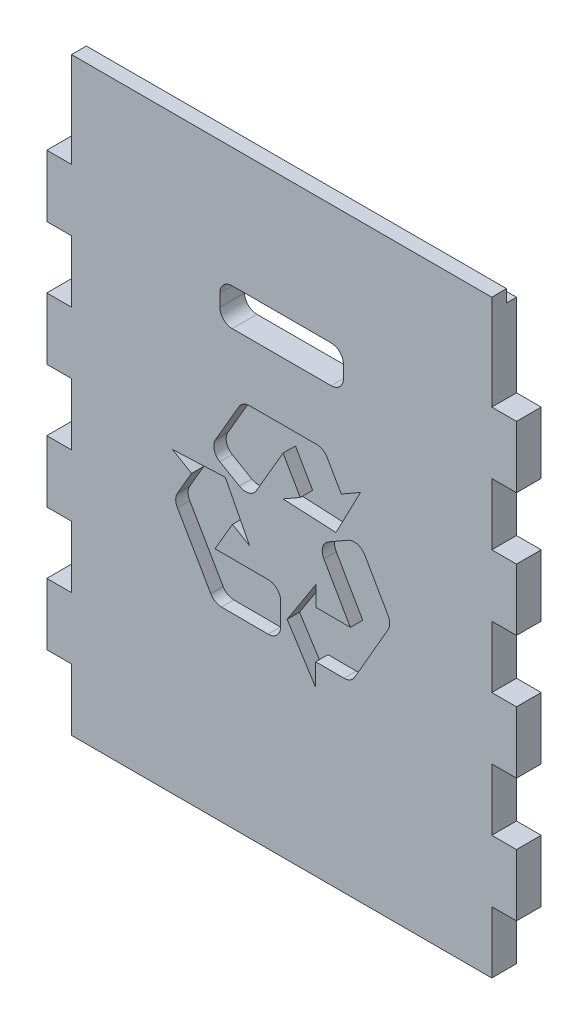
ISO-10303-21;
HEADER;
FILE_DESCRIPTION(('STEP AP214'),'2;1');
FILE_NAME('part.step','',(''),(''),'','','');
FILE_SCHEMA(('AUTOMOTIVE_DESIGN { 1 0 10303 214 1 1 1 1 }'));
ENDSEC;
DATA;
#1=APPLICATION_CONTEXT('core data for automotive mechanical design processes');
#2=APPLICATION_PROTOCOL_DEFINITION('international standard','automotive_design',2000,#1);
#3=PRODUCT_CONTEXT('',#1,'mechanical');
#4=PRODUCT('Part','Part','',(#3));
#5=PRODUCT_RELATED_PRODUCT_CATEGORY('part','',(#4));
#6=PRODUCT_DEFINITION_FORMATION('','',#4);
#7=PRODUCT_DEFINITION_CONTEXT('part definition',#1,'design');
#8=PRODUCT_DEFINITION('design','',#6,#7);
#9=PRODUCT_DEFINITION_SHAPE('','',#8);
#10=(LENGTH_UNIT() NAMED_UNIT(*) SI_UNIT(.MILLI.,.METRE.));
#11=(NAMED_UNIT(*) PLANE_ANGLE_UNIT() SI_UNIT($,.RADIAN.));
#12=(NAMED_UNIT(*) SI_UNIT($,.STERADIAN.) SOLID_ANGLE_UNIT());
#13=UNCERTAINTY_MEASURE_WITH_UNIT(LENGTH_MEASURE(1.E-05),#10,'distance_accuracy_value','');
#14=(GEOMETRIC_REPRESENTATION_CONTEXT(3) GLOBAL_UNCERTAINTY_ASSIGNED_CONTEXT((#13)) GLOBAL_UNIT_ASSIGNED_CONTEXT((#10,
#11,#12)) REPRESENTATION_CONTEXT('',''));
#15=CARTESIAN_POINT('',(0.,0.,0.));
#16=DIRECTION('',(0.,0.,1.));
#17=DIRECTION('',(1.,0.,0.));
#18=AXIS2_PLACEMENT_3D('',#15,#16,#17);
#19=CARTESIAN_POINT('',(19.9999999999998,477.,20.));
#20=DIRECTION('',(0.,-1.,0.));
#21=DIRECTION('',(0.,0.,-1.));
#22=AXIS2_PLACEMENT_3D('',#19,#20,#21);
#23=PLANE('',#22);
#24=DIRECTION('',(1.,0.,0.));
#25=VECTOR('',#24,1.);
#26=CARTESIAN_POINT('',(360.,477.,8.));
#27=LINE('',#26,#25);
#28=CARTESIAN_POINT('',(19.9999999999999,477.,8.));
#29=VERTEX_POINT('',#28);
#30=CARTESIAN_POINT('',(360.,477.,8.));
#31=VERTEX_POINT('',#30);
#32=EDGE_CURVE('E587',#29,#31,#27,.T.);
#33=ORIENTED_EDGE('',*,*,#32,.F.);
#34=DIRECTION('',(0.,0.,-1.));
#35=VECTOR('',#34,1.);
#36=CARTESIAN_POINT('',(19.9999999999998,477.,20.));
#37=LINE('',#36,#35);
#38=CARTESIAN_POINT('',(19.9999999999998,477.,20.));
#39=VERTEX_POINT('',#38);
#40=EDGE_CURVE('E1192',#39,#29,#37,.T.);
#41=ORIENTED_EDGE('',*,*,#40,.F.);
#42=DIRECTION('',(-1.,0.,0.));
#43=VECTOR('',#42,1.);
#44=CARTESIAN_POINT('',(19.9999999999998,477.,20.));
#45=LINE('',#44,#43);
#46=CARTESIAN_POINT('',(360.,477.,20.));
#47=VERTEX_POINT('',#46);
#48=EDGE_CURVE('E1042',#47,#39,#45,.T.);
#49=ORIENTED_EDGE('',*,*,#48,.F.);
#50=DIRECTION('',(0.,0.,-1.));
#51=VECTOR('',#50,1.);
#52=CARTESIAN_POINT('',(360.,477.,20.));
#53=LINE('',#52,#51);
#54=EDGE_CURVE('E1195',#47,#31,#53,.T.);
#55=ORIENTED_EDGE('',*,*,#54,.T.);
#56=EDGE_LOOP('',(#33,#41,#49,#55));
#57=FACE_BOUND('',#56,.T.);
#58=ADVANCED_FACE('F31',(#57),#23,.F.);
#59=CARTESIAN_POINT('',(20.,0.,20.));
#60=DIRECTION('',(1.,0.,0.));
#61=DIRECTION('',(0.,0.,-1.));
#62=AXIS2_PLACEMENT_3D('',#59,#60,#61);
#63=PLANE('',#62);
#64=DIRECTION('',(0.,-1.,0.));
#65=VECTOR('',#64,1.);
#66=CARTESIAN_POINT('',(20.,0.,0.));
#67=LINE('',#66,#65);
#68=CARTESIAN_POINT('',(20.,50.,0.));
#69=VERTEX_POINT('',#68);
#70=CARTESIAN_POINT('',(20.,0.,0.));
#71=VERTEX_POINT('',#70);
#72=EDGE_CURVE('E987',#69,#71,#67,.T.);
#73=ORIENTED_EDGE('',*,*,#72,.T.);
#74=DIRECTION('',(0.,0.,-1.));
#75=VECTOR('',#74,1.);
#76=CARTESIAN_POINT('',(20.,0.,20.));
#77=LINE('',#76,#75);
#78=CARTESIAN_POINT('',(20.,0.,20.));
#79=VERTEX_POINT('',#78);
#80=EDGE_CURVE('E11',#79,#71,#77,.T.);
#81=ORIENTED_EDGE('',*,*,#80,.F.);
#82=DIRECTION('',(0.,-1.,0.));
#83=VECTOR('',#82,1.);
#84=CARTESIAN_POINT('',(20.,0.,20.));
#85=LINE('',#84,#83);
#86=CARTESIAN_POINT('',(20.,50.,20.));
#87=VERTEX_POINT('',#86);
#88=EDGE_CURVE('E1002',#87,#79,#85,.T.);
#89=ORIENTED_EDGE('',*,*,#88,.F.);
#90=DIRECTION('',(0.,0.,-1.));
#91=VECTOR('',#90,1.);
#92=CARTESIAN_POINT('',(20.,50.,20.));
#93=LINE('',#92,#91);
#94=EDGE_CURVE('E1076',#87,#69,#93,.T.);
#95=ORIENTED_EDGE('',*,*,#94,.T.);
#96=EDGE_LOOP('',(#73,#81,#89,#95));
#97=FACE_BOUND('',#96,.T.);
#98=ADVANCED_FACE('F33',(#97),#63,.F.);
#99=CARTESIAN_POINT('',(20.,0.,20.));
#100=DIRECTION('',(0.,1.,0.));
#101=DIRECTION('',(0.,0.,1.));
#102=AXIS2_PLACEMENT_3D('',#99,#100,#101);
#103=PLANE('',#102);
#104=DIRECTION('',(1.,0.,0.));
#105=VECTOR('',#104,1.);
#106=CARTESIAN_POINT('',(20.,0.,0.));
#107=LINE('',#106,#105);
#108=CARTESIAN_POINT('',(360.,0.,0.));
#109=VERTEX_POINT('',#108);
#110=EDGE_CURVE('E1079',#71,#109,#107,.T.);
#111=ORIENTED_EDGE('',*,*,#110,.T.);
#112=DIRECTION('',(0.,0.,-1.));
#113=VECTOR('',#112,1.);
#114=CARTESIAN_POINT('',(360.,0.,20.));
#115=LINE('',#114,#113);
#116=CARTESIAN_POINT('',(360.,0.,20.));
#117=VERTEX_POINT('',#116);
#118=EDGE_CURVE('E39',#117,#109,#115,.T.);
#119=ORIENTED_EDGE('',*,*,#118,.F.);
#120=DIRECTION('',(1.,0.,0.));
#121=VECTOR('',#120,1.);
#122=CARTESIAN_POINT('',(20.,0.,20.));
#123=LINE('',#122,#121);
#124=EDGE_CURVE('E1005',#79,#117,#123,.T.);
#125=ORIENTED_EDGE('',*,*,#124,.F.);
#126=ORIENTED_EDGE('',*,*,#80,.T.);
#127=EDGE_LOOP('',(#111,#119,#125,#126));
#128=FACE_BOUND('',#127,.T.);
#129=ADVANCED_FACE('F1272',(#128),#103,.F.);
#130=CARTESIAN_POINT('',(360.,50.,20.));
#131=DIRECTION('',(-1.,0.,0.));
#132=DIRECTION('',(0.,0.,1.));
#133=AXIS2_PLACEMENT_3D('',#130,#131,#132);
#134=PLANE('',#133);
#135=DIRECTION('',(0.,1.,0.));
#136=VECTOR('',#135,1.);
#137=CARTESIAN_POINT('',(360.,50.,0.));
#138=LINE('',#137,#136);
#139=CARTESIAN_POINT('',(360.,50.,0.));
#140=VERTEX_POINT('',#139);
#141=EDGE_CURVE('E1081',#109,#140,#138,.T.);
#142=ORIENTED_EDGE('',*,*,#141,.T.);
#143=DIRECTION('',(0.,0.,-1.));
#144=VECTOR('',#143,1.);
#145=CARTESIAN_POINT('',(360.,50.,20.));
#146=LINE('',#145,#144);
#147=CARTESIAN_POINT('',(360.,50.,20.));
#148=VERTEX_POINT('',#147);
#149=EDGE_CURVE('E1241',#148,#140,#146,.T.);
#150=ORIENTED_EDGE('',*,*,#149,.F.);
#151=DIRECTION('',(0.,1.,0.));
#152=VECTOR('',#151,1.);
#153=CARTESIAN_POINT('',(360.,50.,20.));
#154=LINE('',#153,#152);
#155=EDGE_CURVE('E1008',#117,#148,#154,.T.);
#156=ORIENTED_EDGE('',*,*,#155,.F.);
#157=ORIENTED_EDGE('',*,*,#118,.T.);
#158=EDGE_LOOP('',(#142,#150,#156,#157));
#159=FACE_BOUND('',#158,.T.);
#160=ADVANCED_FACE('F1248',(#159),#134,.F.);
#161=CARTESIAN_POINT('',(360.,50.,20.));
#162=DIRECTION('',(0.,1.,0.));
#163=DIRECTION('',(-1.,0.,0.));
#164=AXIS2_PLACEMENT_3D('',#161,#162,#163);
#165=PLANE('',#164);
#166=DIRECTION('',(1.,0.,0.));
#167=VECTOR('',#166,1.);
#168=CARTESIAN_POINT('',(360.,50.,0.));
#169=LINE('',#168,#167);
#170=CARTESIAN_POINT('',(380.,50.,0.));
#171=VERTEX_POINT('',#170);
#172=EDGE_CURVE('E1083',#140,#171,#169,.T.);
#173=ORIENTED_EDGE('',*,*,#172,.T.);
#174=DIRECTION('',(0.,0.,-1.));
#175=VECTOR('',#174,1.);
#176=CARTESIAN_POINT('',(380.,50.,20.));
#177=LINE('',#176,#175);
#178=CARTESIAN_POINT('',(380.,50.,20.));
#179=VERTEX_POINT('',#178);
#180=EDGE_CURVE('E1238',#179,#171,#177,.T.);
#181=ORIENTED_EDGE('',*,*,#180,.F.);
#182=DIRECTION('',(1.,0.,0.));
#183=VECTOR('',#182,1.);
#184=CARTESIAN_POINT('',(360.,50.,20.));
#185=LINE('',#184,#183);
#186=EDGE_CURVE('E1010',#148,#179,#185,.T.);
#187=ORIENTED_EDGE('',*,*,#186,.F.);
#188=ORIENTED_EDGE('',*,*,#149,.T.);
#189=EDGE_LOOP('',(#173,#181,#187,#188));
#190=FACE_BOUND('',#189,.T.);
#191=ADVANCED_FACE('F1260',(#190),#165,.F.);
#192=CARTESIAN_POINT('',(380.,50.,20.));
#193=DIRECTION('',(-1.,0.,0.));
#194=DIRECTION('',(0.,-1.,0.));
#195=AXIS2_PLACEMENT_3D('',#192,#193,#194);
#196=PLANE('',#195);
#197=DIRECTION('',(0.,1.,0.));
#198=VECTOR('',#197,1.);
#199=CARTESIAN_POINT('',(380.,50.,0.));
#200=LINE('',#199,#198);
#201=CARTESIAN_POINT('',(380.,100.,0.));
#202=VERTEX_POINT('',#201);
#203=EDGE_CURVE('E1085',#171,#202,#200,.T.);
#204=ORIENTED_EDGE('',*,*,#203,.T.);
#205=DIRECTION('',(0.,0.,-1.));
#206=VECTOR('',#205,1.);
#207=CARTESIAN_POINT('',(380.,100.,20.));
#208=LINE('',#207,#206);
#209=CARTESIAN_POINT('',(380.,100.,20.));
#210=VERTEX_POINT('',#209);
#211=EDGE_CURVE('E1235',#210,#202,#208,.T.);
#212=ORIENTED_EDGE('',*,*,#211,.F.);
#213=DIRECTION('',(0.,1.,0.));
#214=VECTOR('',#213,1.);
#215=CARTESIAN_POINT('',(380.,50.,20.));
#216=LINE('',#215,#214);
#217=EDGE_CURVE('E1012',#179,#210,#216,.T.);
#218=ORIENTED_EDGE('',*,*,#217,.F.);
#219=ORIENTED_EDGE('',*,*,#180,.T.);
#220=EDGE_LOOP('',(#204,#212,#218,#219));
#221=FACE_BOUND('',#220,.T.);
#222=ADVANCED_FACE('F1264',(#221),#196,.F.);
#223=CARTESIAN_POINT('',(360.,100.,20.));
#224=DIRECTION('',(0.,-1.,0.));
#225=DIRECTION('',(1.,0.,0.));
#226=AXIS2_PLACEMENT_3D('',#223,#224,#225);
#227=PLANE('',#226);
#228=DIRECTION('',(-1.,0.,0.));
#229=VECTOR('',#228,1.);
#230=CARTESIAN_POINT('',(360.,100.,0.));
#231=LINE('',#230,#229);
#232=CARTESIAN_POINT('',(360.,100.,0.));
#233=VERTEX_POINT('',#232);
#234=EDGE_CURVE('E1087',#202,#233,#231,.T.);
#235=ORIENTED_EDGE('',*,*,#234,.T.);
#236=DIRECTION('',(0.,0.,-1.));
#237=VECTOR('',#236,1.);
#238=CARTESIAN_POINT('',(360.,100.,20.));
#239=LINE('',#238,#237);
#240=CARTESIAN_POINT('',(360.,100.,20.));
#241=VERTEX_POINT('',#240);
#242=EDGE_CURVE('E1232',#241,#233,#239,.T.);
#243=ORIENTED_EDGE('',*,*,#242,.F.);
#244=DIRECTION('',(-1.,0.,0.));
#245=VECTOR('',#244,1.);
#246=CARTESIAN_POINT('',(360.,100.,20.));
#247=LINE('',#246,#245);
#248=EDGE_CURVE('E1014',#210,#241,#247,.T.);
#249=ORIENTED_EDGE('',*,*,#248,.F.);
#250=ORIENTED_EDGE('',*,*,#211,.T.);
#251=EDGE_LOOP('',(#235,#243,#249,#250));
#252=FACE_BOUND('',#251,.T.);
#253=ADVANCED_FACE('F1420',(#252),#227,.F.);
#254=CARTESIAN_POINT('',(360.,150.,20.));
#255=DIRECTION('',(-1.,0.,0.));
#256=DIRECTION('',(0.,0.,1.));
#257=AXIS2_PLACEMENT_3D('',#254,#255,#256);
#258=PLANE('',#257);
#259=DIRECTION('',(0.,1.,0.));
#260=VECTOR('',#259,1.);
#261=CARTESIAN_POINT('',(360.,150.,0.));
#262=LINE('',#261,#260);
#263=CARTESIAN_POINT('',(360.,150.,0.));
#264=VERTEX_POINT('',#263);
#265=EDGE_CURVE('E1089',#233,#264,#262,.T.);
#266=ORIENTED_EDGE('',*,*,#265,.T.);
#267=DIRECTION('',(0.,0.,-1.));
#268=VECTOR('',#267,1.);
#269=CARTESIAN_POINT('',(360.,150.,20.));
#270=LINE('',#269,#268);
#271=CARTESIAN_POINT('',(360.,150.,20.));
#272=VERTEX_POINT('',#271);
#273=EDGE_CURVE('E1229',#272,#264,#270,.T.);
#274=ORIENTED_EDGE('',*,*,#273,.F.);
#275=DIRECTION('',(0.,1.,0.));
#276=VECTOR('',#275,1.);
#277=CARTESIAN_POINT('',(360.,150.,20.));
#278=LINE('',#277,#276);
#279=EDGE_CURVE('E1016',#241,#272,#278,.T.);
#280=ORIENTED_EDGE('',*,*,#279,.F.);
#281=ORIENTED_EDGE('',*,*,#242,.T.);
#282=EDGE_LOOP('',(#266,#274,#280,#281));
#283=FACE_BOUND('',#282,.T.);
#284=ADVANCED_FACE('F1418',(#283),#258,.F.);
#285=CARTESIAN_POINT('',(360.,150.,20.));
#286=DIRECTION('',(0.,1.,0.));
#287=DIRECTION('',(0.,0.,1.));
#288=AXIS2_PLACEMENT_3D('',#285,#286,#287);
#289=PLANE('',#288);
#290=DIRECTION('',(1.,0.,0.));
#291=VECTOR('',#290,1.);
#292=CARTESIAN_POINT('',(360.,150.,0.));
#293=LINE('',#292,#291);
#294=CARTESIAN_POINT('',(379.999999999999,150.,0.));
#295=VERTEX_POINT('',#294);
#296=EDGE_CURVE('E1091',#264,#295,#293,.T.);
#297=ORIENTED_EDGE('',*,*,#296,.T.);
#298=DIRECTION('',(0.,0.,-1.));
#299=VECTOR('',#298,1.);
#300=CARTESIAN_POINT('',(379.999999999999,150.,20.));
#301=LINE('',#300,#299);
#302=CARTESIAN_POINT('',(379.999999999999,150.,20.));
#303=VERTEX_POINT('',#302);
#304=EDGE_CURVE('E1226',#303,#295,#301,.T.);
#305=ORIENTED_EDGE('',*,*,#304,.F.);
#306=DIRECTION('',(1.,0.,0.));
#307=VECTOR('',#306,1.);
#308=CARTESIAN_POINT('',(360.,150.,20.));
#309=LINE('',#308,#307);
#310=EDGE_CURVE('E1018',#272,#303,#309,.T.);
#311=ORIENTED_EDGE('',*,*,#310,.F.);
#312=ORIENTED_EDGE('',*,*,#273,.T.);
#313=EDGE_LOOP('',(#297,#305,#311,#312));
#314=FACE_BOUND('',#313,.T.);
#315=ADVANCED_FACE('F1413',(#314),#289,.F.);
#316=CARTESIAN_POINT('',(379.999999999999,150.,20.));
#317=DIRECTION('',(-1.,0.,0.));
#318=DIRECTION('',(0.,-1.,0.));
#319=AXIS2_PLACEMENT_3D('',#316,#317,#318);
#320=PLANE('',#319);
#321=DIRECTION('',(0.,1.,0.));
#322=VECTOR('',#321,1.);
#323=CARTESIAN_POINT('',(379.999999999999,150.,0.));
#324=LINE('',#323,#322);
#325=CARTESIAN_POINT('',(379.999999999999,200.,0.));
#326=VERTEX_POINT('',#325);
#327=EDGE_CURVE('E1093',#295,#326,#324,.T.);
#328=ORIENTED_EDGE('',*,*,#327,.T.);
#329=DIRECTION('',(0.,0.,-1.));
#330=VECTOR('',#329,1.);
#331=CARTESIAN_POINT('',(379.999999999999,200.,20.));
#332=LINE('',#331,#330);
#333=CARTESIAN_POINT('',(379.999999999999,200.,20.));
#334=VERTEX_POINT('',#333);
#335=EDGE_CURVE('E1223',#334,#326,#332,.T.);
#336=ORIENTED_EDGE('',*,*,#335,.F.);
#337=DIRECTION('',(0.,1.,0.));
#338=VECTOR('',#337,1.);
#339=CARTESIAN_POINT('',(379.999999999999,150.,20.));
#340=LINE('',#339,#338);
#341=EDGE_CURVE('E1020',#303,#334,#340,.T.);
#342=ORIENTED_EDGE('',*,*,#341,.F.);
#343=ORIENTED_EDGE('',*,*,#304,.T.);
#344=EDGE_LOOP('',(#328,#336,#342,#343));
#345=FACE_BOUND('',#344,.T.);
#346=ADVANCED_FACE('F1408',(#345),#320,.F.);
#347=CARTESIAN_POINT('',(360.,200.,20.));
#348=DIRECTION('',(0.,-1.,0.));
#349=DIRECTION('',(0.,0.,-1.));
#350=AXIS2_PLACEMENT_3D('',#347,#348,#349);
#351=PLANE('',#350);
#352=DIRECTION('',(-1.,0.,0.));
#353=VECTOR('',#352,1.);
#354=CARTESIAN_POINT('',(360.,200.,0.));
#355=LINE('',#354,#353);
#356=CARTESIAN_POINT('',(360.,200.,0.));
#357=VERTEX_POINT('',#356);
#358=EDGE_CURVE('E1095',#326,#357,#355,.T.);
#359=ORIENTED_EDGE('',*,*,#358,.T.);
#360=DIRECTION('',(0.,0.,-1.));
#361=VECTOR('',#360,1.);
#362=CARTESIAN_POINT('',(360.,200.,20.));
#363=LINE('',#362,#361);
#364=CARTESIAN_POINT('',(360.,200.,20.));
#365=VERTEX_POINT('',#364);
#366=EDGE_CURVE('E1220',#365,#357,#363,.T.);
#367=ORIENTED_EDGE('',*,*,#366,.F.);
#368=DIRECTION('',(-1.,0.,0.));
#369=VECTOR('',#368,1.);
#370=CARTESIAN_POINT('',(360.,200.,20.));
#371=LINE('',#370,#369);
#372=EDGE_CURVE('E1022',#334,#365,#371,.T.);
#373=ORIENTED_EDGE('',*,*,#372,.F.);
#374=ORIENTED_EDGE('',*,*,#335,.T.);
#375=EDGE_LOOP('',(#359,#367,#373,#374));
#376=FACE_BOUND('',#375,.T.);
#377=ADVANCED_FACE('F1404',(#376),#351,.F.);
#378=CARTESIAN_POINT('',(360.,250.,20.));
#379=DIRECTION('',(-1.,0.,0.));
#380=DIRECTION('',(0.,-1.,0.));
#381=AXIS2_PLACEMENT_3D('',#378,#379,#380);
#382=PLANE('',#381);
#383=DIRECTION('',(0.,1.,0.));
#384=VECTOR('',#383,1.);
#385=CARTESIAN_POINT('',(360.,250.,0.));
#386=LINE('',#385,#384);
#387=CARTESIAN_POINT('',(360.,250.,0.));
#388=VERTEX_POINT('',#387);
#389=EDGE_CURVE('E1097',#357,#388,#386,.T.);
#390=ORIENTED_EDGE('',*,*,#389,.T.);
#391=DIRECTION('',(0.,0.,-1.));
#392=VECTOR('',#391,1.);
#393=CARTESIAN_POINT('',(360.,250.,20.));
#394=LINE('',#393,#392);
#395=CARTESIAN_POINT('',(360.,250.,20.));
#396=VERTEX_POINT('',#395);
#397=EDGE_CURVE('E1217',#396,#388,#394,.T.);
#398=ORIENTED_EDGE('',*,*,#397,.F.);
#399=DIRECTION('',(0.,1.,0.));
#400=VECTOR('',#399,1.);
#401=CARTESIAN_POINT('',(360.,250.,20.));
#402=LINE('',#401,#400);
#403=EDGE_CURVE('E1024',#365,#396,#402,.T.);
#404=ORIENTED_EDGE('',*,*,#403,.F.);
#405=ORIENTED_EDGE('',*,*,#366,.T.);
#406=EDGE_LOOP('',(#390,#398,#404,#405));
#407=FACE_BOUND('',#406,.T.);
#408=ADVANCED_FACE('F1399',(#407),#382,.F.);
#409=CARTESIAN_POINT('',(360.,250.,20.));
#410=DIRECTION('',(0.,1.,0.));
#411=DIRECTION('',(0.,0.,1.));
#412=AXIS2_PLACEMENT_3D('',#409,#410,#411);
#413=PLANE('',#412);
#414=DIRECTION('',(1.,0.,0.));
#415=VECTOR('',#414,1.);
#416=CARTESIAN_POINT('',(360.,250.,0.));
#417=LINE('',#416,#415);
#418=CARTESIAN_POINT('',(379.999999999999,250.,0.));
#419=VERTEX_POINT('',#418);
#420=EDGE_CURVE('E1099',#388,#419,#417,.T.);
#421=ORIENTED_EDGE('',*,*,#420,.T.);
#422=DIRECTION('',(0.,0.,-1.));
#423=VECTOR('',#422,1.);
#424=CARTESIAN_POINT('',(379.999999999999,250.,20.));
#425=LINE('',#424,#423);
#426=CARTESIAN_POINT('',(379.999999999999,250.,20.));
#427=VERTEX_POINT('',#426);
#428=EDGE_CURVE('E1214',#427,#419,#425,.T.);
#429=ORIENTED_EDGE('',*,*,#428,.F.);
#430=DIRECTION('',(1.,0.,0.));
#431=VECTOR('',#430,1.);
#432=CARTESIAN_POINT('',(360.,250.,20.));
#433=LINE('',#432,#431);
#434=EDGE_CURVE('E1026',#396,#427,#433,.T.);
#435=ORIENTED_EDGE('',*,*,#434,.F.);
#436=ORIENTED_EDGE('',*,*,#397,.T.);
#437=EDGE_LOOP('',(#421,#429,#435,#436));
#438=FACE_BOUND('',#437,.T.);
#439=ADVANCED_FACE('F1393',(#438),#413,.F.);
#440=CARTESIAN_POINT('',(379.999999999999,250.,20.));
#441=DIRECTION('',(-1.,0.,0.));
#442=DIRECTION('',(0.,-1.,0.));
#443=AXIS2_PLACEMENT_3D('',#440,#441,#442);
#444=PLANE('',#443);
#445=DIRECTION('',(0.,1.,0.));
#446=VECTOR('',#445,1.);
#447=CARTESIAN_POINT('',(379.999999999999,250.,0.));
#448=LINE('',#447,#446);
#449=CARTESIAN_POINT('',(379.999999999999,300.,0.));
#450=VERTEX_POINT('',#449);
#451=EDGE_CURVE('E1101',#419,#450,#448,.T.);
#452=ORIENTED_EDGE('',*,*,#451,.T.);
#453=DIRECTION('',(0.,0.,-1.));
#454=VECTOR('',#453,1.);
#455=CARTESIAN_POINT('',(379.999999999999,300.,20.));
#456=LINE('',#455,#454);
#457=CARTESIAN_POINT('',(379.999999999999,300.,20.));
#458=VERTEX_POINT('',#457);
#459=EDGE_CURVE('E1211',#458,#450,#456,.T.);
#460=ORIENTED_EDGE('',*,*,#459,.F.);
#461=DIRECTION('',(0.,1.,0.));
#462=VECTOR('',#461,1.);
#463=CARTESIAN_POINT('',(379.999999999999,250.,20.));
#464=LINE('',#463,#462);
#465=EDGE_CURVE('E1028',#427,#458,#464,.T.);
#466=ORIENTED_EDGE('',*,*,#465,.F.);
#467=ORIENTED_EDGE('',*,*,#428,.T.);
#468=EDGE_LOOP('',(#452,#460,#466,#467));
#469=FACE_BOUND('',#468,.T.);
#470=ADVANCED_FACE('F1389',(#469),#444,.F.);
#471=CARTESIAN_POINT('',(360.,300.,20.));
#472=DIRECTION('',(0.,-1.,0.));
#473=DIRECTION('',(0.,0.,-1.));
#474=AXIS2_PLACEMENT_3D('',#471,#472,#473);
#475=PLANE('',#474);
#476=DIRECTION('',(-1.,0.,0.));
#477=VECTOR('',#476,1.);
#478=CARTESIAN_POINT('',(360.,300.,0.));
#479=LINE('',#478,#477);
#480=CARTESIAN_POINT('',(360.,300.,0.));
#481=VERTEX_POINT('',#480);
#482=EDGE_CURVE('E1103',#450,#481,#479,.T.);
#483=ORIENTED_EDGE('',*,*,#482,.T.);
#484=DIRECTION('',(0.,0.,-1.));
#485=VECTOR('',#484,1.);
#486=CARTESIAN_POINT('',(360.,300.,20.));
#487=LINE('',#486,#485);
#488=CARTESIAN_POINT('',(360.,300.,20.));
#489=VERTEX_POINT('',#488);
#490=EDGE_CURVE('E1208',#489,#481,#487,.T.);
#491=ORIENTED_EDGE('',*,*,#490,.F.);
#492=DIRECTION('',(-1.,0.,0.));
#493=VECTOR('',#492,1.);
#494=CARTESIAN_POINT('',(360.,300.,20.));
#495=LINE('',#494,#493);
#496=EDGE_CURVE('E1030',#458,#489,#495,.T.);
#497=ORIENTED_EDGE('',*,*,#496,.F.);
#498=ORIENTED_EDGE('',*,*,#459,.T.);
#499=EDGE_LOOP('',(#483,#491,#497,#498));
#500=FACE_BOUND('',#499,.T.);
#501=ADVANCED_FACE('F1384',(#500),#475,.F.);
#502=CARTESIAN_POINT('',(360.,350.,20.));
#503=DIRECTION('',(-1.,0.,0.));
#504=DIRECTION('',(0.,0.,1.));
#505=AXIS2_PLACEMENT_3D('',#502,#503,#504);
#506=PLANE('',#505);
#507=DIRECTION('',(0.,1.,0.));
#508=VECTOR('',#507,1.);
#509=CARTESIAN_POINT('',(360.,350.,0.));
#510=LINE('',#509,#508);
#511=CARTESIAN_POINT('',(360.,350.,0.));
#512=VERTEX_POINT('',#511);
#513=EDGE_CURVE('E1105',#481,#512,#510,.T.);
#514=ORIENTED_EDGE('',*,*,#513,.T.);
#515=DIRECTION('',(0.,0.,-1.));
#516=VECTOR('',#515,1.);
#517=CARTESIAN_POINT('',(360.,350.,20.));
#518=LINE('',#517,#516);
#519=CARTESIAN_POINT('',(360.,350.,20.));
#520=VERTEX_POINT('',#519);
#521=EDGE_CURVE('E1205',#520,#512,#518,.T.);
#522=ORIENTED_EDGE('',*,*,#521,.F.);
#523=DIRECTION('',(0.,1.,0.));
#524=VECTOR('',#523,1.);
#525=CARTESIAN_POINT('',(360.,350.,20.));
#526=LINE('',#525,#524);
#527=EDGE_CURVE('E1032',#489,#520,#526,.T.);
#528=ORIENTED_EDGE('',*,*,#527,.F.);
#529=ORIENTED_EDGE('',*,*,#490,.T.);
#530=EDGE_LOOP('',(#514,#522,#528,#529));
#531=FACE_BOUND('',#530,.T.);
#532=ADVANCED_FACE('F1378',(#531),#506,.F.);
#533=CARTESIAN_POINT('',(360.,350.,20.));
#534=DIRECTION('',(0.,1.,0.));
#535=DIRECTION('',(0.,0.,1.));
#536=AXIS2_PLACEMENT_3D('',#533,#534,#535);
#537=PLANE('',#536);
#538=DIRECTION('',(1.,0.,0.));
#539=VECTOR('',#538,1.);
#540=CARTESIAN_POINT('',(360.,350.,0.));
#541=LINE('',#540,#539);
#542=CARTESIAN_POINT('',(379.999999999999,350.,0.));
#543=VERTEX_POINT('',#542);
#544=EDGE_CURVE('E1107',#512,#543,#541,.T.);
#545=ORIENTED_EDGE('',*,*,#544,.T.);
#546=DIRECTION('',(0.,0.,-1.));
#547=VECTOR('',#546,1.);
#548=CARTESIAN_POINT('',(379.999999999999,350.,20.));
#549=LINE('',#548,#547);
#550=CARTESIAN_POINT('',(379.999999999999,350.,20.));
#551=VERTEX_POINT('',#550);
#552=EDGE_CURVE('E1202',#551,#543,#549,.T.);
#553=ORIENTED_EDGE('',*,*,#552,.F.);
#554=DIRECTION('',(1.,0.,0.));
#555=VECTOR('',#554,1.);
#556=CARTESIAN_POINT('',(360.,350.,20.));
#557=LINE('',#556,#555);
#558=EDGE_CURVE('E1034',#520,#551,#557,.T.);
#559=ORIENTED_EDGE('',*,*,#558,.F.);
#560=ORIENTED_EDGE('',*,*,#521,.T.);
#561=EDGE_LOOP('',(#545,#553,#559,#560));
#562=FACE_BOUND('',#561,.T.);
#563=ADVANCED_FACE('F1374',(#562),#537,.F.);
#564=CARTESIAN_POINT('',(379.999999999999,350.,20.));
#565=DIRECTION('',(-1.,0.,0.));
#566=DIRECTION('',(0.,-1.,0.));
#567=AXIS2_PLACEMENT_3D('',#564,#565,#566);
#568=PLANE('',#567);
#569=DIRECTION('',(0.,1.,0.));
#570=VECTOR('',#569,1.);
#571=CARTESIAN_POINT('',(379.999999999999,350.,0.));
#572=LINE('',#571,#570);
#573=CARTESIAN_POINT('',(379.999999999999,400.,0.));
#574=VERTEX_POINT('',#573);
#575=EDGE_CURVE('E1109',#543,#574,#572,.T.);
#576=ORIENTED_EDGE('',*,*,#575,.T.);
#577=DIRECTION('',(0.,0.,-1.));
#578=VECTOR('',#577,1.);
#579=CARTESIAN_POINT('',(379.999999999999,400.,20.));
#580=LINE('',#579,#578);
#581=CARTESIAN_POINT('',(379.999999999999,400.,20.));
#582=VERTEX_POINT('',#581);
#583=EDGE_CURVE('E1199',#582,#574,#580,.T.);
#584=ORIENTED_EDGE('',*,*,#583,.F.);
#585=DIRECTION('',(0.,1.,0.));
#586=VECTOR('',#585,1.);
#587=CARTESIAN_POINT('',(379.999999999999,350.,20.));
#588=LINE('',#587,#586);
#589=EDGE_CURVE('E1036',#551,#582,#588,.T.);
#590=ORIENTED_EDGE('',*,*,#589,.F.);
#591=ORIENTED_EDGE('',*,*,#552,.T.);
#592=EDGE_LOOP('',(#576,#584,#590,#591));
#593=FACE_BOUND('',#592,.T.);
#594=ADVANCED_FACE('F1370',(#593),#568,.F.);
#595=CARTESIAN_POINT('',(360.,400.,20.));
#596=DIRECTION('',(0.,-1.,0.));
#597=DIRECTION('',(0.,0.,-1.));
#598=AXIS2_PLACEMENT_3D('',#595,#596,#597);
#599=PLANE('',#598);
#600=DIRECTION('',(-1.,0.,0.));
#601=VECTOR('',#600,1.);
#602=CARTESIAN_POINT('',(360.,400.,0.));
#603=LINE('',#602,#601);
#604=CARTESIAN_POINT('',(360.,400.,0.));
#605=VERTEX_POINT('',#604);
#606=EDGE_CURVE('E1111',#574,#605,#603,.T.);
#607=ORIENTED_EDGE('',*,*,#606,.T.);
#608=DIRECTION('',(0.,0.,-1.));
#609=VECTOR('',#608,1.);
#610=CARTESIAN_POINT('',(360.,400.,20.));
#611=LINE('',#610,#609);
#612=CARTESIAN_POINT('',(360.,400.,20.));
#613=VERTEX_POINT('',#612);
#614=EDGE_CURVE('E1197',#613,#605,#611,.T.);
#615=ORIENTED_EDGE('',*,*,#614,.F.);
#616=DIRECTION('',(-1.,0.,0.));
#617=VECTOR('',#616,1.);
#618=CARTESIAN_POINT('',(360.,400.,20.));
#619=LINE('',#618,#617);
#620=EDGE_CURVE('E1038',#582,#613,#619,.T.);
#621=ORIENTED_EDGE('',*,*,#620,.F.);
#622=ORIENTED_EDGE('',*,*,#583,.T.);
#623=EDGE_LOOP('',(#607,#615,#621,#622));
#624=FACE_BOUND('',#623,.T.);
#625=ADVANCED_FACE('F1364',(#624),#599,.F.);
#626=CARTESIAN_POINT('',(360.,477.,20.));
#627=DIRECTION('',(-1.,0.,0.));
#628=DIRECTION('',(0.,0.,1.));
#629=AXIS2_PLACEMENT_3D('',#626,#627,#628);
#630=PLANE('',#629);
#631=DIRECTION('',(0.,1.,0.));
#632=VECTOR('',#631,1.);
#633=CARTESIAN_POINT('',(360.,477.,0.));
#634=LINE('',#633,#632);
#635=CARTESIAN_POINT('',(360.,467.,0.));
#636=VERTEX_POINT('',#635);
#637=EDGE_CURVE('E597',#605,#636,#634,.T.);
#638=ORIENTED_EDGE('',*,*,#637,.T.);
#639=DIRECTION('',(0.,0.,-1.));
#640=VECTOR('',#639,1.);
#641=CARTESIAN_POINT('',(360.,467.,8.));
#642=LINE('',#641,#640);
#643=CARTESIAN_POINT('',(360.,467.,8.));
#644=VERTEX_POINT('',#643);
#645=EDGE_CURVE('E46',#644,#636,#642,.T.);
#646=ORIENTED_EDGE('',*,*,#645,.F.);
#647=DIRECTION('',(0.,-1.,0.));
#648=VECTOR('',#647,1.);
#649=CARTESIAN_POINT('',(360.,477.,8.));
#650=LINE('',#649,#648);
#651=EDGE_CURVE('E582',#31,#644,#650,.T.);
#652=ORIENTED_EDGE('',*,*,#651,.F.);
#653=ORIENTED_EDGE('',*,*,#54,.F.);
#654=DIRECTION('',(0.,1.,0.));
#655=VECTOR('',#654,1.);
#656=CARTESIAN_POINT('',(360.,477.,20.));
#657=LINE('',#656,#655);
#658=EDGE_CURVE('E1040',#613,#47,#657,.T.);
#659=ORIENTED_EDGE('',*,*,#658,.F.);
#660=ORIENTED_EDGE('',*,*,#614,.T.);
#661=EDGE_LOOP('',(#638,#646,#652,#653,#659,#660));
#662=FACE_BOUND('',#661,.T.);
#663=ADVANCED_FACE('F594',(#662),#630,.F.);
#664=CARTESIAN_POINT('',(20.,400.,20.));
#665=DIRECTION('',(1.,0.,0.));
#666=DIRECTION('',(0.,1.,0.));
#667=AXIS2_PLACEMENT_3D('',#664,#665,#666);
#668=PLANE('',#667);
#669=DIRECTION('',(0.,1.,0.));
#670=VECTOR('',#669,1.);
#671=CARTESIAN_POINT('',(19.9999999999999,477.,8.));
#672=LINE('',#671,#670);
#673=CARTESIAN_POINT('',(19.9999999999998,467.,8.));
#674=VERTEX_POINT('',#673);
#675=EDGE_CURVE('E581',#674,#29,#672,.T.);
#676=ORIENTED_EDGE('',*,*,#675,.F.);
#677=DIRECTION('',(0.,0.,-1.));
#678=VECTOR('',#677,1.);
#679=CARTESIAN_POINT('',(19.9999999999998,467.,8.));
#680=LINE('',#679,#678);
#681=CARTESIAN_POINT('',(19.9999999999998,467.,0.));
#682=VERTEX_POINT('',#681);
#683=EDGE_CURVE('E578',#674,#682,#680,.T.);
#684=ORIENTED_EDGE('',*,*,#683,.T.);
#685=DIRECTION('',(0.,-1.,0.));
#686=VECTOR('',#685,1.);
#687=CARTESIAN_POINT('',(20.,400.,0.));
#688=LINE('',#687,#686);
#689=CARTESIAN_POINT('',(20.,400.,0.));
#690=VERTEX_POINT('',#689);
#691=EDGE_CURVE('E1114',#682,#690,#688,.T.);
#692=ORIENTED_EDGE('',*,*,#691,.T.);
#693=DIRECTION('',(0.,0.,-1.));
#694=VECTOR('',#693,1.);
#695=CARTESIAN_POINT('',(20.,400.,20.));
#696=LINE('',#695,#694);
#697=CARTESIAN_POINT('',(20.,400.,20.));
#698=VERTEX_POINT('',#697);
#699=EDGE_CURVE('E1189',#698,#690,#696,.T.);
#700=ORIENTED_EDGE('',*,*,#699,.F.);
#701=DIRECTION('',(0.,-1.,0.));
#702=VECTOR('',#701,1.);
#703=CARTESIAN_POINT('',(20.,400.,20.));
#704=LINE('',#703,#702);
#705=EDGE_CURVE('E1044',#39,#698,#704,.T.);
#706=ORIENTED_EDGE('',*,*,#705,.F.);
#707=ORIENTED_EDGE('',*,*,#40,.T.);
#708=EDGE_LOOP('',(#676,#684,#692,#700,#706,#707));
#709=FACE_BOUND('',#708,.T.);
#710=ADVANCED_FACE('F1352',(#709),#668,.F.);
#711=CARTESIAN_POINT('',(-1.39659334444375E-12,400.,20.));
#712=DIRECTION('',(0.,-1.,0.));
#713=DIRECTION('',(0.,0.,-1.));
#714=AXIS2_PLACEMENT_3D('',#711,#712,#713);
#715=PLANE('',#714);
#716=DIRECTION('',(-1.,0.,0.));
#717=VECTOR('',#716,1.);
#718=CARTESIAN_POINT('',(-1.39659334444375E-12,400.,0.));
#719=LINE('',#718,#717);
#720=CARTESIAN_POINT('',(-1.39659334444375E-12,400.,0.));
#721=VERTEX_POINT('',#720);
#722=EDGE_CURVE('E1116',#690,#721,#719,.T.);
#723=ORIENTED_EDGE('',*,*,#722,.T.);
#724=DIRECTION('',(0.,0.,-1.));
#725=VECTOR('',#724,1.);
#726=CARTESIAN_POINT('',(-1.39659334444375E-12,400.,20.));
#727=LINE('',#726,#725);
#728=CARTESIAN_POINT('',(-1.39659334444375E-12,400.,20.));
#729=VERTEX_POINT('',#728);
#730=EDGE_CURVE('E1186',#729,#721,#727,.T.);
#731=ORIENTED_EDGE('',*,*,#730,.F.);
#732=DIRECTION('',(-1.,0.,0.));
#733=VECTOR('',#732,1.);
#734=CARTESIAN_POINT('',(-1.39659334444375E-12,400.,20.));
#735=LINE('',#734,#733);
#736=EDGE_CURVE('E1046',#698,#729,#735,.T.);
#737=ORIENTED_EDGE('',*,*,#736,.F.);
#738=ORIENTED_EDGE('',*,*,#699,.T.);
#739=EDGE_LOOP('',(#723,#731,#737,#738));
#740=FACE_BOUND('',#739,.T.);
#741=ADVANCED_FACE('F1348',(#740),#715,.F.);
#742=CARTESIAN_POINT('',(-1.22201917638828E-12,350.,20.));
#743=DIRECTION('',(1.,0.,0.));
#744=DIRECTION('',(0.,1.,0.));
#745=AXIS2_PLACEMENT_3D('',#742,#743,#744);
#746=PLANE('',#745);
#747=DIRECTION('',(0.,-1.,0.));
#748=VECTOR('',#747,1.);
#749=CARTESIAN_POINT('',(-1.22201917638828E-12,350.,0.));
#750=LINE('',#749,#748);
#751=CARTESIAN_POINT('',(-1.22201917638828E-12,350.,0.));
#752=VERTEX_POINT('',#751);
#753=EDGE_CURVE('E1118',#721,#752,#750,.T.);
#754=ORIENTED_EDGE('',*,*,#753,.T.);
#755=DIRECTION('',(0.,0.,-1.));
#756=VECTOR('',#755,1.);
#757=CARTESIAN_POINT('',(-1.22201917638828E-12,350.,20.));
#758=LINE('',#757,#756);
#759=CARTESIAN_POINT('',(-1.22201917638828E-12,350.,20.));
#760=VERTEX_POINT('',#759);
#761=EDGE_CURVE('E1183',#760,#752,#758,.T.);
#762=ORIENTED_EDGE('',*,*,#761,.F.);
#763=DIRECTION('',(0.,-1.,0.));
#764=VECTOR('',#763,1.);
#765=CARTESIAN_POINT('',(-1.22201917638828E-12,350.,20.));
#766=LINE('',#765,#764);
#767=EDGE_CURVE('E1048',#729,#760,#766,.T.);
#768=ORIENTED_EDGE('',*,*,#767,.F.);
#769=ORIENTED_EDGE('',*,*,#730,.T.);
#770=EDGE_LOOP('',(#754,#762,#768,#769));
#771=FACE_BOUND('',#770,.T.);
#772=ADVANCED_FACE('F1344',(#771),#746,.F.);
#773=CARTESIAN_POINT('',(-1.22201917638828E-12,350.,20.));
#774=DIRECTION('',(0.,1.,0.));
#775=DIRECTION('',(0.,0.,1.));
#776=AXIS2_PLACEMENT_3D('',#773,#774,#775);
#777=PLANE('',#776);
#778=DIRECTION('',(1.,0.,0.));
#779=VECTOR('',#778,1.);
#780=CARTESIAN_POINT('',(-1.22201917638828E-12,350.,0.));
#781=LINE('',#780,#779);
#782=CARTESIAN_POINT('',(20.,350.,0.));
#783=VERTEX_POINT('',#782);
#784=EDGE_CURVE('E1120',#752,#783,#781,.T.);
#785=ORIENTED_EDGE('',*,*,#784,.T.);
#786=DIRECTION('',(0.,0.,-1.));
#787=VECTOR('',#786,1.);
#788=CARTESIAN_POINT('',(20.,350.,20.));
#789=LINE('',#788,#787);
#790=CARTESIAN_POINT('',(20.,350.,20.));
#791=VERTEX_POINT('',#790);
#792=EDGE_CURVE('E1180',#791,#783,#789,.T.);
#793=ORIENTED_EDGE('',*,*,#792,.F.);
#794=DIRECTION('',(1.,0.,0.));
#795=VECTOR('',#794,1.);
#796=CARTESIAN_POINT('',(-1.22201917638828E-12,350.,20.));
#797=LINE('',#796,#795);
#798=EDGE_CURVE('E1050',#760,#791,#797,.T.);
#799=ORIENTED_EDGE('',*,*,#798,.F.);
#800=ORIENTED_EDGE('',*,*,#761,.T.);
#801=EDGE_LOOP('',(#785,#793,#799,#800));
#802=FACE_BOUND('',#801,.T.);
#803=ADVANCED_FACE('F1339',(#802),#777,.F.);
#804=CARTESIAN_POINT('',(20.,300.,20.));
#805=DIRECTION('',(1.,0.,0.));
#806=DIRECTION('',(0.,0.,-1.));
#807=AXIS2_PLACEMENT_3D('',#804,#805,#806);
#808=PLANE('',#807);
#809=DIRECTION('',(0.,-1.,0.));
#810=VECTOR('',#809,1.);
#811=CARTESIAN_POINT('',(20.,300.,0.));
#812=LINE('',#811,#810);
#813=CARTESIAN_POINT('',(20.,300.,0.));
#814=VERTEX_POINT('',#813);
#815=EDGE_CURVE('E1122',#783,#814,#812,.T.);
#816=ORIENTED_EDGE('',*,*,#815,.T.);
#817=DIRECTION('',(0.,0.,-1.));
#818=VECTOR('',#817,1.);
#819=CARTESIAN_POINT('',(20.,300.,20.));
#820=LINE('',#819,#818);
#821=CARTESIAN_POINT('',(20.,300.,20.));
#822=VERTEX_POINT('',#821);
#823=EDGE_CURVE('E1177',#822,#814,#820,.T.);
#824=ORIENTED_EDGE('',*,*,#823,.F.);
#825=DIRECTION('',(0.,-1.,0.));
#826=VECTOR('',#825,1.);
#827=CARTESIAN_POINT('',(20.,300.,20.));
#828=LINE('',#827,#826);
#829=EDGE_CURVE('E1052',#791,#822,#828,.T.);
#830=ORIENTED_EDGE('',*,*,#829,.F.);
#831=ORIENTED_EDGE('',*,*,#792,.T.);
#832=EDGE_LOOP('',(#816,#824,#830,#831));
#833=FACE_BOUND('',#832,.T.);
#834=ADVANCED_FACE('F1333',(#833),#808,.F.);
#835=CARTESIAN_POINT('',(-1.04744500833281E-12,300.,20.));
#836=DIRECTION('',(0.,-1.,0.));
#837=DIRECTION('',(0.,0.,-1.));
#838=AXIS2_PLACEMENT_3D('',#835,#836,#837);
#839=PLANE('',#838);
#840=DIRECTION('',(-1.,0.,0.));
#841=VECTOR('',#840,1.);
#842=CARTESIAN_POINT('',(-1.04744500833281E-12,300.,0.));
#843=LINE('',#842,#841);
#844=CARTESIAN_POINT('',(-1.04744500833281E-12,300.,0.));
#845=VERTEX_POINT('',#844);
#846=EDGE_CURVE('E1124',#814,#845,#843,.T.);
#847=ORIENTED_EDGE('',*,*,#846,.T.);
#848=DIRECTION('',(0.,0.,-1.));
#849=VECTOR('',#848,1.);
#850=CARTESIAN_POINT('',(-1.04744500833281E-12,300.,20.));
#851=LINE('',#850,#849);
#852=CARTESIAN_POINT('',(-1.04744500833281E-12,300.,20.));
#853=VERTEX_POINT('',#852);
#854=EDGE_CURVE('E1174',#853,#845,#851,.T.);
#855=ORIENTED_EDGE('',*,*,#854,.F.);
#856=DIRECTION('',(-1.,0.,0.));
#857=VECTOR('',#856,1.);
#858=CARTESIAN_POINT('',(-1.04744500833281E-12,300.,20.));
#859=LINE('',#858,#857);
#860=EDGE_CURVE('E1054',#822,#853,#859,.T.);
#861=ORIENTED_EDGE('',*,*,#860,.F.);
#862=ORIENTED_EDGE('',*,*,#823,.T.);
#863=EDGE_LOOP('',(#847,#855,#861,#862));
#864=FACE_BOUND('',#863,.T.);
#865=ADVANCED_FACE('F1329',(#864),#839,.F.);
#866=CARTESIAN_POINT('',(-8.72870840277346E-13,250.,20.));
#867=DIRECTION('',(1.,0.,0.));
#868=DIRECTION('',(0.,1.,0.));
#869=AXIS2_PLACEMENT_3D('',#866,#867,#868);
#870=PLANE('',#869);
#871=DIRECTION('',(0.,-1.,0.));
#872=VECTOR('',#871,1.);
#873=CARTESIAN_POINT('',(-8.72870840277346E-13,250.,0.));
#874=LINE('',#873,#872);
#875=CARTESIAN_POINT('',(-8.72870840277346E-13,250.,0.));
#876=VERTEX_POINT('',#875);
#877=EDGE_CURVE('E1126',#845,#876,#874,.T.);
#878=ORIENTED_EDGE('',*,*,#877,.T.);
#879=DIRECTION('',(0.,0.,-1.));
#880=VECTOR('',#879,1.);
#881=CARTESIAN_POINT('',(-8.72870840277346E-13,250.,20.));
#882=LINE('',#881,#880);
#883=CARTESIAN_POINT('',(-8.72870840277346E-13,250.,20.));
#884=VERTEX_POINT('',#883);
#885=EDGE_CURVE('E1171',#884,#876,#882,.T.);
#886=ORIENTED_EDGE('',*,*,#885,.F.);
#887=DIRECTION('',(0.,-1.,0.));
#888=VECTOR('',#887,1.);
#889=CARTESIAN_POINT('',(-8.72870840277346E-13,250.,20.));
#890=LINE('',#889,#888);
#891=EDGE_CURVE('E1056',#853,#884,#890,.T.);
#892=ORIENTED_EDGE('',*,*,#891,.F.);
#893=ORIENTED_EDGE('',*,*,#854,.T.);
#894=EDGE_LOOP('',(#878,#886,#892,#893));
#895=FACE_BOUND('',#894,.T.);
#896=ADVANCED_FACE('F1324',(#895),#870,.F.);
#897=CARTESIAN_POINT('',(-8.72870840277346E-13,250.,20.));
#898=DIRECTION('',(0.,1.,0.));
#899=DIRECTION('',(0.,0.,1.));
#900=AXIS2_PLACEMENT_3D('',#897,#898,#899);
#901=PLANE('',#900);
#902=DIRECTION('',(1.,0.,0.));
#903=VECTOR('',#902,1.);
#904=CARTESIAN_POINT('',(-8.72870840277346E-13,250.,0.));
#905=LINE('',#904,#903);
#906=CARTESIAN_POINT('',(20.,250.,0.));
#907=VERTEX_POINT('',#906);
#908=EDGE_CURVE('E1128',#876,#907,#905,.T.);
#909=ORIENTED_EDGE('',*,*,#908,.T.);
#910=DIRECTION('',(0.,0.,-1.));
#911=VECTOR('',#910,1.);
#912=CARTESIAN_POINT('',(20.,250.,20.));
#913=LINE('',#912,#911);
#914=CARTESIAN_POINT('',(20.,250.,20.));
#915=VERTEX_POINT('',#914);
#916=EDGE_CURVE('E1168',#915,#907,#913,.T.);
#917=ORIENTED_EDGE('',*,*,#916,.F.);
#918=DIRECTION('',(1.,0.,0.));
#919=VECTOR('',#918,1.);
#920=CARTESIAN_POINT('',(-8.72870840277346E-13,250.,20.));
#921=LINE('',#920,#919);
#922=EDGE_CURVE('E1058',#884,#915,#921,.T.);
#923=ORIENTED_EDGE('',*,*,#922,.F.);
#924=ORIENTED_EDGE('',*,*,#885,.T.);
#925=EDGE_LOOP('',(#909,#917,#923,#924));
#926=FACE_BOUND('',#925,.T.);
#927=ADVANCED_FACE('F1318',(#926),#901,.F.);
#928=CARTESIAN_POINT('',(20.,200.,20.));
#929=DIRECTION('',(1.,0.,0.));
#930=DIRECTION('',(0.,0.,-1.));
#931=AXIS2_PLACEMENT_3D('',#928,#929,#930);
#932=PLANE('',#931);
#933=DIRECTION('',(0.,-1.,0.));
#934=VECTOR('',#933,1.);
#935=CARTESIAN_POINT('',(20.,200.,0.));
#936=LINE('',#935,#934);
#937=CARTESIAN_POINT('',(20.,200.,0.));
#938=VERTEX_POINT('',#937);
#939=EDGE_CURVE('E1130',#907,#938,#936,.T.);
#940=ORIENTED_EDGE('',*,*,#939,.T.);
#941=DIRECTION('',(0.,0.,-1.));
#942=VECTOR('',#941,1.);
#943=CARTESIAN_POINT('',(20.,200.,20.));
#944=LINE('',#943,#942);
#945=CARTESIAN_POINT('',(20.,200.,20.));
#946=VERTEX_POINT('',#945);
#947=EDGE_CURVE('E1165',#946,#938,#944,.T.);
#948=ORIENTED_EDGE('',*,*,#947,.F.);
#949=DIRECTION('',(0.,-1.,0.));
#950=VECTOR('',#949,1.);
#951=CARTESIAN_POINT('',(20.,200.,20.));
#952=LINE('',#951,#950);
#953=EDGE_CURVE('E1060',#915,#946,#952,.T.);
#954=ORIENTED_EDGE('',*,*,#953,.F.);
#955=ORIENTED_EDGE('',*,*,#916,.T.);
#956=EDGE_LOOP('',(#940,#948,#954,#955));
#957=FACE_BOUND('',#956,.T.);
#958=ADVANCED_FACE('F1314',(#957),#932,.F.);
#959=CARTESIAN_POINT('',(-6.98296672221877E-13,200.,20.));
#960=DIRECTION('',(0.,-1.,0.));
#961=DIRECTION('',(0.,0.,-1.));
#962=AXIS2_PLACEMENT_3D('',#959,#960,#961);
#963=PLANE('',#962);
#964=DIRECTION('',(-1.,0.,0.));
#965=VECTOR('',#964,1.);
#966=CARTESIAN_POINT('',(-6.98296672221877E-13,200.,0.));
#967=LINE('',#966,#965);
#968=CARTESIAN_POINT('',(-6.98296672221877E-13,200.,0.));
#969=VERTEX_POINT('',#968);
#970=EDGE_CURVE('E1132',#938,#969,#967,.T.);
#971=ORIENTED_EDGE('',*,*,#970,.T.);
#972=DIRECTION('',(0.,0.,-1.));
#973=VECTOR('',#972,1.);
#974=CARTESIAN_POINT('',(-6.98296672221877E-13,200.,20.));
#975=LINE('',#974,#973);
#976=CARTESIAN_POINT('',(-6.98296672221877E-13,200.,20.));
#977=VERTEX_POINT('',#976);
#978=EDGE_CURVE('E1162',#977,#969,#975,.T.);
#979=ORIENTED_EDGE('',*,*,#978,.F.);
#980=DIRECTION('',(-1.,0.,0.));
#981=VECTOR('',#980,1.);
#982=CARTESIAN_POINT('',(-6.98296672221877E-13,200.,20.));
#983=LINE('',#982,#981);
#984=EDGE_CURVE('E1062',#946,#977,#983,.T.);
#985=ORIENTED_EDGE('',*,*,#984,.F.);
#986=ORIENTED_EDGE('',*,*,#947,.T.);
#987=EDGE_LOOP('',(#971,#979,#985,#986));
#988=FACE_BOUND('',#987,.T.);
#989=ADVANCED_FACE('F1309',(#988),#963,.F.);
#990=CARTESIAN_POINT('',(-5.23722504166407E-13,150.,20.));
#991=DIRECTION('',(1.,0.,0.));
#992=DIRECTION('',(0.,1.,0.));
#993=AXIS2_PLACEMENT_3D('',#990,#991,#992);
#994=PLANE('',#993);
#995=DIRECTION('',(0.,-1.,0.));
#996=VECTOR('',#995,1.);
#997=CARTESIAN_POINT('',(-5.23722504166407E-13,150.,0.));
#998=LINE('',#997,#996);
#999=CARTESIAN_POINT('',(-5.23722504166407E-13,150.,0.));
#1000=VERTEX_POINT('',#999);
#1001=EDGE_CURVE('E1134',#969,#1000,#998,.T.);
#1002=ORIENTED_EDGE('',*,*,#1001,.T.);
#1003=DIRECTION('',(0.,0.,-1.));
#1004=VECTOR('',#1003,1.);
#1005=CARTESIAN_POINT('',(-5.23722504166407E-13,150.,20.));
#1006=LINE('',#1005,#1004);
#1007=CARTESIAN_POINT('',(-5.23722504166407E-13,150.,20.));
#1008=VERTEX_POINT('',#1007);
#1009=EDGE_CURVE('E1159',#1008,#1000,#1006,.T.);
#1010=ORIENTED_EDGE('',*,*,#1009,.F.);
#1011=DIRECTION('',(0.,-1.,0.));
#1012=VECTOR('',#1011,1.);
#1013=CARTESIAN_POINT('',(-5.23722504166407E-13,150.,20.));
#1014=LINE('',#1013,#1012);
#1015=EDGE_CURVE('E1064',#977,#1008,#1014,.T.);
#1016=ORIENTED_EDGE('',*,*,#1015,.F.);
#1017=ORIENTED_EDGE('',*,*,#978,.T.);
#1018=EDGE_LOOP('',(#1002,#1010,#1016,#1017));
#1019=FACE_BOUND('',#1018,.T.);
#1020=ADVANCED_FACE('F1303',(#1019),#994,.F.);
#1021=CARTESIAN_POINT('',(-5.23722504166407E-13,150.,20.));
#1022=DIRECTION('',(0.,1.,0.));
#1023=DIRECTION('',(0.,0.,1.));
#1024=AXIS2_PLACEMENT_3D('',#1021,#1022,#1023);
#1025=PLANE('',#1024);
#1026=DIRECTION('',(1.,0.,0.));
#1027=VECTOR('',#1026,1.);
#1028=CARTESIAN_POINT('',(-5.23722504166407E-13,150.,0.));
#1029=LINE('',#1028,#1027);
#1030=CARTESIAN_POINT('',(20.,150.,0.));
#1031=VERTEX_POINT('',#1030);
#1032=EDGE_CURVE('E1136',#1000,#1031,#1029,.T.);
#1033=ORIENTED_EDGE('',*,*,#1032,.T.);
#1034=DIRECTION('',(0.,0.,-1.));
#1035=VECTOR('',#1034,1.);
#1036=CARTESIAN_POINT('',(20.,150.,20.));
#1037=LINE('',#1036,#1035);
#1038=CARTESIAN_POINT('',(20.,150.,20.));
#1039=VERTEX_POINT('',#1038);
#1040=EDGE_CURVE('E1156',#1039,#1031,#1037,.T.);
#1041=ORIENTED_EDGE('',*,*,#1040,.F.);
#1042=DIRECTION('',(1.,0.,0.));
#1043=VECTOR('',#1042,1.);
#1044=CARTESIAN_POINT('',(-5.23722504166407E-13,150.,20.));
#1045=LINE('',#1044,#1043);
#1046=EDGE_CURVE('E1066',#1008,#1039,#1045,.T.);
#1047=ORIENTED_EDGE('',*,*,#1046,.F.);
#1048=ORIENTED_EDGE('',*,*,#1009,.T.);
#1049=EDGE_LOOP('',(#1033,#1041,#1047,#1048));
#1050=FACE_BOUND('',#1049,.T.);
#1051=ADVANCED_FACE('F1299',(#1050),#1025,.F.);
#1052=CARTESIAN_POINT('',(20.,100.,20.));
#1053=DIRECTION('',(1.,0.,0.));
#1054=DIRECTION('',(0.,0.,-1.));
#1055=AXIS2_PLACEMENT_3D('',#1052,#1053,#1054);
#1056=PLANE('',#1055);
#1057=DIRECTION('',(0.,-1.,0.));
#1058=VECTOR('',#1057,1.);
#1059=CARTESIAN_POINT('',(20.,100.,0.));
#1060=LINE('',#1059,#1058);
#1061=CARTESIAN_POINT('',(20.,100.,0.));
#1062=VERTEX_POINT('',#1061);
#1063=EDGE_CURVE('E1138',#1031,#1062,#1060,.T.);
#1064=ORIENTED_EDGE('',*,*,#1063,.T.);
#1065=DIRECTION('',(0.,0.,-1.));
#1066=VECTOR('',#1065,1.);
#1067=CARTESIAN_POINT('',(20.,100.,20.));
#1068=LINE('',#1067,#1066);
#1069=CARTESIAN_POINT('',(20.,100.,20.));
#1070=VERTEX_POINT('',#1069);
#1071=EDGE_CURVE('E1153',#1070,#1062,#1068,.T.);
#1072=ORIENTED_EDGE('',*,*,#1071,.F.);
#1073=DIRECTION('',(0.,-1.,0.));
#1074=VECTOR('',#1073,1.);
#1075=CARTESIAN_POINT('',(20.,100.,20.));
#1076=LINE('',#1075,#1074);
#1077=EDGE_CURVE('E1068',#1039,#1070,#1076,.T.);
#1078=ORIENTED_EDGE('',*,*,#1077,.F.);
#1079=ORIENTED_EDGE('',*,*,#1040,.T.);
#1080=EDGE_LOOP('',(#1064,#1072,#1078,#1079));
#1081=FACE_BOUND('',#1080,.T.);
#1082=ADVANCED_FACE('F1294',(#1081),#1056,.F.);
#1083=CARTESIAN_POINT('',(-3.49148336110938E-13,100.,20.));
#1084=DIRECTION('',(0.,-1.,0.));
#1085=DIRECTION('',(0.,0.,-1.));
#1086=AXIS2_PLACEMENT_3D('',#1083,#1084,#1085);
#1087=PLANE('',#1086);
#1088=DIRECTION('',(-1.,0.,0.));
#1089=VECTOR('',#1088,1.);
#1090=CARTESIAN_POINT('',(-3.49148336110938E-13,100.,0.));
#1091=LINE('',#1090,#1089);
#1092=CARTESIAN_POINT('',(-3.49148336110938E-13,100.,0.));
#1093=VERTEX_POINT('',#1092);
#1094=EDGE_CURVE('E1140',#1062,#1093,#1091,.T.);
#1095=ORIENTED_EDGE('',*,*,#1094,.T.);
#1096=DIRECTION('',(0.,0.,-1.));
#1097=VECTOR('',#1096,1.);
#1098=CARTESIAN_POINT('',(-3.49148336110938E-13,100.,20.));
#1099=LINE('',#1098,#1097);
#1100=CARTESIAN_POINT('',(-3.49148336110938E-13,100.,20.));
#1101=VERTEX_POINT('',#1100);
#1102=EDGE_CURVE('E1150',#1101,#1093,#1099,.T.);
#1103=ORIENTED_EDGE('',*,*,#1102,.F.);
#1104=DIRECTION('',(-1.,0.,0.));
#1105=VECTOR('',#1104,1.);
#1106=CARTESIAN_POINT('',(-3.49148336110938E-13,100.,20.));
#1107=LINE('',#1106,#1105);
#1108=EDGE_CURVE('E1070',#1070,#1101,#1107,.T.);
#1109=ORIENTED_EDGE('',*,*,#1108,.F.);
#1110=ORIENTED_EDGE('',*,*,#1071,.T.);
#1111=EDGE_LOOP('',(#1095,#1103,#1109,#1110));
#1112=FACE_BOUND('',#1111,.T.);
#1113=ADVANCED_FACE('F1288',(#1112),#1087,.F.);
#1114=CARTESIAN_POINT('',(-1.74574168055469E-13,50.,20.));
#1115=DIRECTION('',(1.,0.,0.));
#1116=DIRECTION('',(0.,1.,0.));
#1117=AXIS2_PLACEMENT_3D('',#1114,#1115,#1116);
#1118=PLANE('',#1117);
#1119=DIRECTION('',(0.,-1.,0.));
#1120=VECTOR('',#1119,1.);
#1121=CARTESIAN_POINT('',(-1.74574168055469E-13,50.,0.));
#1122=LINE('',#1121,#1120);
#1123=CARTESIAN_POINT('',(-1.74574168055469E-13,50.,0.));
#1124=VERTEX_POINT('',#1123);
#1125=EDGE_CURVE('E1142',#1093,#1124,#1122,.T.);
#1126=ORIENTED_EDGE('',*,*,#1125,.T.);
#1127=DIRECTION('',(0.,0.,-1.));
#1128=VECTOR('',#1127,1.);
#1129=CARTESIAN_POINT('',(-1.74574168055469E-13,50.,20.));
#1130=LINE('',#1129,#1128);
#1131=CARTESIAN_POINT('',(-1.74574168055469E-13,50.,20.));
#1132=VERTEX_POINT('',#1131);
#1133=EDGE_CURVE('E1147',#1132,#1124,#1130,.T.);
#1134=ORIENTED_EDGE('',*,*,#1133,.F.);
#1135=DIRECTION('',(0.,-1.,0.));
#1136=VECTOR('',#1135,1.);
#1137=CARTESIAN_POINT('',(-1.74574168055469E-13,50.,20.));
#1138=LINE('',#1137,#1136);
#1139=EDGE_CURVE('E1072',#1101,#1132,#1138,.T.);
#1140=ORIENTED_EDGE('',*,*,#1139,.F.);
#1141=ORIENTED_EDGE('',*,*,#1102,.T.);
#1142=EDGE_LOOP('',(#1126,#1134,#1140,#1141));
#1143=FACE_BOUND('',#1142,.T.);
#1144=ADVANCED_FACE('F1284',(#1143),#1118,.F.);
#1145=CARTESIAN_POINT('',(-1.74574168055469E-13,50.,20.));
#1146=DIRECTION('',(0.,1.,0.));
#1147=DIRECTION('',(0.,0.,1.));
#1148=AXIS2_PLACEMENT_3D('',#1145,#1146,#1147);
#1149=PLANE('',#1148);
#1150=DIRECTION('',(1.,0.,0.));
#1151=VECTOR('',#1150,1.);
#1152=CARTESIAN_POINT('',(-1.74574168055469E-13,50.,0.));
#1153=LINE('',#1152,#1151);
#1154=EDGE_CURVE('E1006',#1124,#69,#1153,.T.);
#1155=ORIENTED_EDGE('',*,*,#1154,.T.);
#1156=ORIENTED_EDGE('',*,*,#94,.F.);
#1157=DIRECTION('',(1.,0.,0.));
#1158=VECTOR('',#1157,1.);
#1159=CARTESIAN_POINT('',(-1.74574168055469E-13,50.,20.));
#1160=LINE('',#1159,#1158);
#1161=EDGE_CURVE('E1074',#1132,#87,#1160,.T.);
#1162=ORIENTED_EDGE('',*,*,#1161,.F.);
#1163=ORIENTED_EDGE('',*,*,#1133,.T.);
#1164=EDGE_LOOP('',(#1155,#1156,#1162,#1163));
#1165=FACE_BOUND('',#1164,.T.);
#1166=ADVANCED_FACE('F1279',(#1165),#1149,.F.);
#1167=CARTESIAN_POINT('',(20.,50.,20.));
#1168=DIRECTION('',(0.,0.,-1.));
#1169=DIRECTION('',(-1.,0.,0.));
#1170=AXIS2_PLACEMENT_3D('',#1167,#1168,#1169);
#1171=PLANE('',#1170);
#1172=DIRECTION('',(0.999994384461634,-0.00335127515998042,0.));
#1173=VECTOR('',#1172,1.);
#1174=CARTESIAN_POINT('',(141.322737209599,150.570910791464,20.));
#1175=LINE('',#1174,#1173);
#1176=CARTESIAN_POINT('',(141.322737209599,150.570910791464,20.));
#1177=VERTEX_POINT('',#1176);
#1178=CARTESIAN_POINT('',(179.118172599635,150.444247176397,20.));
#1179=VERTEX_POINT('',#1178);
#1180=EDGE_CURVE('E648',#1177,#1179,#1175,.T.);
#1181=ORIENTED_EDGE('',*,*,#1180,.F.);
#1182=CARTESIAN_POINT('',(141.356249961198,160.570854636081,20.));
#1183=DIRECTION('',(0.,0.,1.));
#1184=DIRECTION('',(1.,0.,0.));
#1185=AXIS2_PLACEMENT_3D('',#1182,#1183,#1184);
#1186=CIRCLE('',#1185,10.0000000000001);
#1187=CARTESIAN_POINT('',(132.695995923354,155.570854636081,20.));
#1188=VERTEX_POINT('',#1187);
#1189=EDGE_CURVE('E54',#1188,#1177,#1186,.T.);
#1190=ORIENTED_EDGE('',*,*,#1189,.F.);
#1191=DIRECTION('',(0.499999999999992,-0.866025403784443,0.));
#1192=VECTOR('',#1191,1.);
#1193=CARTESIAN_POINT('',(132.695995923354,155.570854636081,20.));
#1194=LINE('',#1193,#1192);
#1195=CARTESIAN_POINT('',(105.647633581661,202.419992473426,20.));
#1196=VERTEX_POINT('',#1195);
#1197=EDGE_CURVE('E607',#1196,#1188,#1194,.T.);
#1198=ORIENTED_EDGE('',*,*,#1197,.F.);
#1199=CARTESIAN_POINT('',(114.307887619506,207.419992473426,20.));
#1200=DIRECTION('',(0.,0.,1.));
#1201=DIRECTION('',(-1.,0.,0.));
#1202=AXIS2_PLACEMENT_3D('',#1199,#1200,#1201);
#1203=CIRCLE('',#1202,9.99999999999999);
#1204=CARTESIAN_POINT('',(105.66443858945,212.44898728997,20.));
#1205=VERTEX_POINT('',#1204);
#1206=EDGE_CURVE('E681',#1205,#1196,#1203,.T.);
#1207=ORIENTED_EDGE('',*,*,#1206,.F.);
#1208=DIRECTION('',(-0.502899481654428,-0.864344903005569,0.));
#1209=VECTOR('',#1208,1.);
#1210=CARTESIAN_POINT('',(117.138052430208,232.168951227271,20.));
#1211=LINE('',#1210,#1209);
#1212=CARTESIAN_POINT('',(117.138052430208,232.168951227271,20.));
#1213=VERTEX_POINT('',#1212);
#1214=EDGE_CURVE('E678',#1213,#1205,#1211,.T.);
#1215=ORIENTED_EDGE('',*,*,#1214,.F.);
#1216=DIRECTION('',(0.864344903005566,-0.502899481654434,0.));
#1217=VECTOR('',#1216,1.);
#1218=CARTESIAN_POINT('',(117.138052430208,232.168951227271,20.));
#1219=LINE('',#1218,#1217);
#1220=CARTESIAN_POINT('',(101.642218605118,241.184850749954,20.));
#1221=VERTEX_POINT('',#1220);
#1222=EDGE_CURVE('E675',#1221,#1213,#1219,.T.);
#1223=ORIENTED_EDGE('',*,*,#1222,.F.);
#1224=DIRECTION('',(-0.999068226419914,-0.0431587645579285,0.));
#1225=VECTOR('',#1224,1.);
#1226=CARTESIAN_POINT('',(101.642218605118,241.184850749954,20.));
#1227=LINE('',#1226,#1225);
#1228=CARTESIAN_POINT('',(144.476372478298,243.035244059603,20.));
#1229=VERTEX_POINT('',#1228);
#1230=EDGE_CURVE('E672',#1229,#1221,#1227,.T.);
#1231=ORIENTED_EDGE('',*,*,#1230,.F.);
#1232=DIRECTION('',(-0.456203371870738,0.889875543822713,0.));
#1233=VECTOR('',#1232,1.);
#1234=CARTESIAN_POINT('',(144.476372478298,243.035244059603,20.));
#1235=LINE('',#1234,#1233);
#1236=CARTESIAN_POINT('',(164.035682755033,204.882628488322,20.));
#1237=VERTEX_POINT('',#1236);
#1238=EDGE_CURVE('E669',#1237,#1229,#1235,.T.);
#1239=ORIENTED_EDGE('',*,*,#1238,.F.);
#1240=DIRECTION('',(0.864344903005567,-0.502899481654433,0.));
#1241=VECTOR('',#1240,1.);
#1242=CARTESIAN_POINT('',(164.035682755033,204.882628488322,20.));
#1243=LINE('',#1242,#1241);
#1244=CARTESIAN_POINT('',(150.189331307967,212.938814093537,20.));
#1245=VERTEX_POINT('',#1244);
#1246=EDGE_CURVE('E666',#1245,#1237,#1243,.T.);
#1247=ORIENTED_EDGE('',*,*,#1246,.F.);
#1248=DIRECTION('',(0.502899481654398,0.864344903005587,0.));
#1249=VECTOR('',#1248,1.);
#1250=CARTESIAN_POINT('',(150.189331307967,212.938814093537,20.));
#1251=LINE('',#1250,#1249);
#1252=CARTESIAN_POINT('',(136.16039372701,188.826956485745,20.));
#1253=VERTEX_POINT('',#1252);
#1254=EDGE_CURVE('E663',#1253,#1245,#1251,.T.);
#1255=ORIENTED_EDGE('',*,*,#1254,.F.);
#1256=DIRECTION('',(-0.999994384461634,0.00335127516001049,0.));
#1257=VECTOR('',#1256,1.);
#1258=CARTESIAN_POINT('',(136.16039372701,188.826956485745,20.));
#1259=LINE('',#1258,#1257);
#1260=CARTESIAN_POINT('',(179.246320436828,188.682562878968,20.));
#1261=VERTEX_POINT('',#1260);
#1262=EDGE_CURVE('E660',#1261,#1253,#1259,.T.);
#1263=ORIENTED_EDGE('',*,*,#1262,.F.);
#1264=CARTESIAN_POINT('',(179.212807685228,178.682619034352,20.));
#1265=DIRECTION('',(0.,0.,1.));
#1266=DIRECTION('',(-1.,0.,0.));
#1267=AXIS2_PLACEMENT_3D('',#1264,#1265,#1266);
#1268=CIRCLE('',#1267,9.99999999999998);
#1269=CARTESIAN_POINT('',(189.212751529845,178.649106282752,20.));
#1270=VERTEX_POINT('',#1269);
#1271=EDGE_CURVE('E657',#1270,#1261,#1268,.T.);
#1272=ORIENTED_EDGE('',*,*,#1271,.F.);
#1273=DIRECTION('',(0.00335127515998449,0.999994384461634,0.));
#1274=VECTOR('',#1273,1.);
#1275=CARTESIAN_POINT('',(189.151629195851,160.410678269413,20.));
#1276=LINE('',#1275,#1274);
#1277=CARTESIAN_POINT('',(189.151629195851,160.410678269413,20.));
#1278=VERTEX_POINT('',#1277);
#1279=EDGE_CURVE('E654',#1278,#1270,#1276,.T.);
#1280=ORIENTED_EDGE('',*,*,#1279,.F.);
#1281=CARTESIAN_POINT('',(179.151685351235,160.444191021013,20.));
#1282=DIRECTION('',(0.,0.,1.));
#1283=DIRECTION('',(1.,0.,0.));
#1284=AXIS2_PLACEMENT_3D('',#1281,#1282,#1283);
#1285=CIRCLE('',#1284,10.);
#1286=EDGE_CURVE('E651',#1179,#1278,#1285,.T.);
#1287=ORIENTED_EDGE('',*,*,#1286,.F.);
#1288=EDGE_LOOP('',(#1181,#1190,#1198,#1207,#1215,#1223,#1231,#1239,#1247,#1255,#1263,#1272,
#1280,#1287));
#1289=FACE_BOUND('',#1288,.T.);
#1290=DIRECTION('',(-0.4970949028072,0.867696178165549,0.));
#1291=VECTOR('',#1290,1.);
#1292=CARTESIAN_POINT('',(276.12504504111,212.059017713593,20.));
#1293=LINE('',#1292,#1291);
#1294=CARTESIAN_POINT('',(276.12504504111,212.059017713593,20.));
#1295=VERTEX_POINT('',#1294);
#1296=CARTESIAN_POINT('',(257.337021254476,244.854156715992,20.));
#1297=VERTEX_POINT('',#1296);
#1298=EDGE_CURVE('E759',#1295,#1297,#1293,.T.);
#1299=ORIENTED_EDGE('',*,*,#1298,.F.);
#1300=CARTESIAN_POINT('',(267.448083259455,207.088068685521,20.));
#1301=DIRECTION('',(0.,0.,1.));
#1302=DIRECTION('',(1.,0.,0.));
#1303=AXIS2_PLACEMENT_3D('',#1300,#1301,#1302);
#1304=CIRCLE('',#1303,9.99999999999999);
#1305=CARTESIAN_POINT('',(276.108337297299,202.08806868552,20.));
#1306=VERTEX_POINT('',#1305);
#1307=EDGE_CURVE('E688',#1306,#1295,#1304,.T.);
#1308=ORIENTED_EDGE('',*,*,#1307,.F.);
#1309=DIRECTION('',(0.500000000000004,0.866025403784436,0.));
#1310=VECTOR('',#1309,1.);
#1311=CARTESIAN_POINT('',(276.108337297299,202.08806868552,20.));
#1312=LINE('',#1311,#1310);
#1313=CARTESIAN_POINT('',(249.059974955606,155.238930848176,20.));
#1314=VERTEX_POINT('',#1313);
#1315=EDGE_CURVE('E718',#1314,#1306,#1312,.T.);
#1316=ORIENTED_EDGE('',*,*,#1315,.F.);
#1317=CARTESIAN_POINT('',(240.399720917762,160.238930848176,20.));
#1318=DIRECTION('',(0.,0.,1.));
#1319=DIRECTION('',(-1.,0.,0.));
#1320=AXIS2_PLACEMENT_3D('',#1317,#1318,#1319);
#1321=CIRCLE('',#1320,10.0000000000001);
#1322=CARTESIAN_POINT('',(240.366208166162,150.23898700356,20.));
#1323=VERTEX_POINT('',#1322);
#1324=EDGE_CURVE('E792',#1323,#1314,#1321,.T.);
#1325=ORIENTED_EDGE('',*,*,#1324,.F.);
#1326=DIRECTION('',(0.999994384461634,-0.00335127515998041,0.));
#1327=VECTOR('',#1326,1.);
#1328=CARTESIAN_POINT('',(217.551411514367,150.315446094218,20.));
#1329=LINE('',#1328,#1327);
#1330=CARTESIAN_POINT('',(217.551411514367,150.315446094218,20.));
#1331=VERTEX_POINT('',#1330);
#1332=EDGE_CURVE('E789',#1331,#1323,#1329,.T.);
#1333=ORIENTED_EDGE('',*,*,#1332,.F.);
#1334=DIRECTION('',(0.00335127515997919,0.999994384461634,0.));
#1335=VECTOR('',#1334,1.);
#1336=CARTESIAN_POINT('',(217.551411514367,150.315446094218,20.));
#1337=LINE('',#1336,#1335);
#1338=CARTESIAN_POINT('',(217.491330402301,132.387710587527,20.));
#1339=VERTEX_POINT('',#1338);
#1340=EDGE_CURVE('E786',#1339,#1331,#1337,.T.);
#1341=ORIENTED_EDGE('',*,*,#1340,.F.);
#1342=DIRECTION('',(0.536910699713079,-0.843639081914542,0.));
#1343=VECTOR('',#1342,1.);
#1344=CARTESIAN_POINT('',(217.491330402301,132.387710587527,20.));
#1345=LINE('',#1344,#1343);
#1346=CARTESIAN_POINT('',(194.471765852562,168.557979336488,20.));
#1347=VERTEX_POINT('',#1346);
#1348=EDGE_CURVE('E783',#1347,#1339,#1345,.T.);
#1349=ORIENTED_EDGE('',*,*,#1348,.F.);
#1350=DIRECTION('',(-0.54255314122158,-0.840021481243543,0.));
#1351=VECTOR('',#1350,1.);
#1352=CARTESIAN_POINT('',(194.471765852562,168.557979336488,20.));
#1353=LINE('',#1352,#1351);
#1354=CARTESIAN_POINT('',(217.733245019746,204.573146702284,20.));
#1355=VERTEX_POINT('',#1354);
#1356=EDGE_CURVE('E780',#1355,#1347,#1353,.T.);
#1357=ORIENTED_EDGE('',*,*,#1356,.F.);
#1358=DIRECTION('',(0.0033512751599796,0.999994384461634,0.));
#1359=VECTOR('',#1358,1.);
#1360=CARTESIAN_POINT('',(217.733245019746,204.573146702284,20.));
#1361=LINE('',#1360,#1359);
#1362=CARTESIAN_POINT('',(217.67955935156,188.553761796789,20.));
#1363=VERTEX_POINT('',#1362);
#1364=EDGE_CURVE('E777',#1363,#1355,#1361,.T.);
#1365=ORIENTED_EDGE('',*,*,#1364,.F.);
#1366=DIRECTION('',(-0.999994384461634,0.00335127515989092,0.));
#1367=VECTOR('',#1366,1.);
#1368=CARTESIAN_POINT('',(217.67955935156,188.553761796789,20.));
#1369=LINE('',#1368,#1367);
#1370=CARTESIAN_POINT('',(245.575509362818,188.460274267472,20.));
#1371=VERTEX_POINT('',#1370);
#1372=EDGE_CURVE('E774',#1371,#1363,#1369,.T.);
#1373=ORIENTED_EDGE('',*,*,#1372,.F.);
#1374=DIRECTION('',(0.497094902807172,-0.867696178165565,0.));
#1375=VECTOR('',#1374,1.);
#1376=CARTESIAN_POINT('',(245.575509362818,188.460274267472,20.));
#1377=LINE('',#1376,#1375);
#1378=CARTESIAN_POINT('',(224.157594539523,225.845978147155,20.));
#1379=VERTEX_POINT('',#1378);
#1380=EDGE_CURVE('E771',#1379,#1371,#1377,.T.);
#1381=ORIENTED_EDGE('',*,*,#1380,.F.);
#1382=CARTESIAN_POINT('',(232.834556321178,230.816927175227,20.));
#1383=DIRECTION('',(0.,0.,1.));
#1384=DIRECTION('',(-1.,0.,0.));
#1385=AXIS2_PLACEMENT_3D('',#1382,#1383,#1384);
#1386=CIRCLE('',#1385,10.);
#1387=CARTESIAN_POINT('',(227.863607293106,239.493888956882,20.));
#1388=VERTEX_POINT('',#1387);
#1389=EDGE_CURVE('E768',#1388,#1379,#1386,.T.);
#1390=ORIENTED_EDGE('',*,*,#1389,.F.);
#1391=DIRECTION('',(-0.867696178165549,-0.497094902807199,0.));
#1392=VECTOR('',#1391,1.);
#1393=CARTESIAN_POINT('',(243.689110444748,248.560169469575,20.));
#1394=LINE('',#1393,#1392);
#1395=CARTESIAN_POINT('',(243.689110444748,248.560169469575,20.));
#1396=VERTEX_POINT('',#1395);
#1397=EDGE_CURVE('E765',#1396,#1388,#1394,.T.);
#1398=ORIENTED_EDGE('',*,*,#1397,.F.);
#1399=CARTESIAN_POINT('',(248.66005947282,239.88320768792,20.));
#1400=DIRECTION('',(0.,0.,1.));
#1401=DIRECTION('',(1.,0.,0.));
#1402=AXIS2_PLACEMENT_3D('',#1399,#1400,#1401);
#1403=CIRCLE('',#1402,10.);
#1404=EDGE_CURVE('E762',#1297,#1396,#1403,.T.);
#1405=ORIENTED_EDGE('',*,*,#1404,.F.);
#1406=EDGE_LOOP('',(#1299,#1308,#1316,#1325,#1333,#1341,#1349,#1357,#1365,#1373,#1381,#1390,
#1398,#1405));
#1407=FACE_BOUND('',#1406,.T.);
#1408=DIRECTION('',(-0.502899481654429,-0.864344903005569,0.));
#1409=VECTOR('',#1408,1.);
#1410=CARTESIAN_POINT('',(155.473628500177,298.057187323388,20.));
#1411=LINE('',#1410,#1409);
#1412=CARTESIAN_POINT('',(155.473628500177,298.057187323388,20.));
#1413=VERTEX_POINT('',#1412);
#1414=CARTESIAN_POINT('',(136.466216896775,265.388711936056,20.));
#1415=VERTEX_POINT('',#1414);
#1416=EDGE_CURVE('E871',#1413,#1415,#1411,.T.);
#1417=ORIENTED_EDGE('',*,*,#1416,.F.);
#1418=CARTESIAN_POINT('',(164.117077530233,293.028192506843,20.));
#1419=DIRECTION('',(0.,0.,1.));
#1420=DIRECTION('',(1.,0.,0.));
#1421=AXIS2_PLACEMENT_3D('',#1418,#1419,#1420);
#1422=CIRCLE('',#1421,9.99999999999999);
#1423=CARTESIAN_POINT('',(164.117077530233,303.028192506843,20.));
#1424=VERTEX_POINT('',#1423);
#1425=EDGE_CURVE('E799',#1424,#1413,#1422,.T.);
#1426=ORIENTED_EDGE('',*,*,#1425,.F.);
#1427=DIRECTION('',(-1.,0.,0.));
#1428=VECTOR('',#1427,1.);
#1429=CARTESIAN_POINT('',(164.117077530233,303.028192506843,20.));
#1430=LINE('',#1429,#1428);
#1431=CARTESIAN_POINT('',(218.213802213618,303.028192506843,20.));
#1432=VERTEX_POINT('',#1431);
#1433=EDGE_CURVE('E830',#1432,#1424,#1430,.T.);
#1434=ORIENTED_EDGE('',*,*,#1433,.F.);
#1435=CARTESIAN_POINT('',(218.213802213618,293.028192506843,20.));
#1436=DIRECTION('',(0.,0.,1.));
#1437=DIRECTION('',(-1.,0.,0.));
#1438=AXIS2_PLACEMENT_3D('',#1435,#1436,#1437);
#1439=CIRCLE('',#1438,10.);
#1440=CARTESIAN_POINT('',(226.890763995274,297.999141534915,20.));
#1441=VERTEX_POINT('',#1440);
#1442=EDGE_CURVE('E904',#1441,#1432,#1439,.T.);
#1443=ORIENTED_EDGE('',*,*,#1442,.F.);
#1444=DIRECTION('',(-0.497094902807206,0.867696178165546,0.));
#1445=VECTOR('',#1444,1.);
#1446=CARTESIAN_POINT('',(238.231946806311,278.202718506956,20.));
#1447=LINE('',#1446,#1445);
#1448=CARTESIAN_POINT('',(238.231946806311,278.202718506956,20.));
#1449=VERTEX_POINT('',#1448);
#1450=EDGE_CURVE('E901',#1449,#1441,#1447,.T.);
#1451=ORIENTED_EDGE('',*,*,#1450,.F.);
#1452=DIRECTION('',(-0.867696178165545,-0.497094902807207,0.));
#1453=VECTOR('',#1452,1.);
#1454=CARTESIAN_POINT('',(238.231946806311,278.202718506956,20.));
#1455=LINE('',#1454,#1453);
#1456=CARTESIAN_POINT('',(253.787861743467,287.114554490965,20.));
#1457=VERTEX_POINT('',#1456);
#1458=EDGE_CURVE('E898',#1457,#1449,#1455,.T.);
#1459=ORIENTED_EDGE('',*,*,#1458,.F.);
#1460=DIRECTION('',(0.462157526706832,0.886797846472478,0.));
#1461=VECTOR('',#1460,1.);
#1462=CARTESIAN_POINT('',(253.787861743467,287.114554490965,20.));
#1463=LINE('',#1462,#1461);
#1464=CARTESIAN_POINT('',(233.973272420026,249.093892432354,20.));
#1465=VERTEX_POINT('',#1464);
#1466=EDGE_CURVE('E895',#1465,#1457,#1463,.T.);
#1467=ORIENTED_EDGE('',*,*,#1466,.F.);
#1468=DIRECTION('',(0.998756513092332,-0.0498540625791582,0.));
#1469=VECTOR('',#1468,1.);
#1470=CARTESIAN_POINT('',(233.973272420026,249.093892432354,20.));
#1471=LINE('',#1470,#1469);
#1472=CARTESIAN_POINT('',(191.152482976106,251.23134063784,20.));
#1473=VERTEX_POINT('',#1472);
#1474=EDGE_CURVE('E892',#1473,#1465,#1471,.T.);
#1475=ORIENTED_EDGE('',*,*,#1474,.F.);
#1476=DIRECTION('',(-0.867696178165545,-0.497094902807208,0.));
#1477=VECTOR('',#1476,1.);
#1478=CARTESIAN_POINT('',(191.152482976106,251.23134063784,20.));
#1479=LINE('',#1478,#1477);
#1480=CARTESIAN_POINT('',(205.052520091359,259.194539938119,20.));
#1481=VERTEX_POINT('',#1480);
#1482=EDGE_CURVE('E889',#1481,#1473,#1479,.T.);
#1483=ORIENTED_EDGE('',*,*,#1482,.F.);
#1484=DIRECTION('',(0.497094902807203,-0.867696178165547,0.));
#1485=VECTOR('',#1484,1.);
#1486=CARTESIAN_POINT('',(205.052520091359,259.194539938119,20.));
#1487=LINE('',#1486,#1485);
#1488=CARTESIAN_POINT('',(191.185507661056,283.399885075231,20.));
#1489=VERTEX_POINT('',#1488);
#1490=EDGE_CURVE('E886',#1489,#1481,#1487,.T.);
#1491=ORIENTED_EDGE('',*,*,#1490,.F.);
#1492=DIRECTION('',(0.50289948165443,0.864344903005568,0.));
#1493=VECTOR('',#1492,1.);
#1494=CARTESIAN_POINT('',(191.185507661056,283.399885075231,20.));
#1495=LINE('',#1494,#1493);
#1496=CARTESIAN_POINT('',(169.517495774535,246.158574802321,20.));
#1497=VERTEX_POINT('',#1496);
#1498=EDGE_CURVE('E883',#1497,#1489,#1495,.T.);
#1499=ORIENTED_EDGE('',*,*,#1498,.F.);
#1500=CARTESIAN_POINT('',(160.87404674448,251.187569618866,20.));
#1501=DIRECTION('',(0.,0.,1.));
#1502=DIRECTION('',(-1.,0.,0.));
#1503=AXIS2_PLACEMENT_3D('',#1500,#1501,#1502);
#1504=CIRCLE('',#1503,10.0000000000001);
#1505=CARTESIAN_POINT('',(155.845051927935,242.54412058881,20.));
#1506=VERTEX_POINT('',#1505);
#1507=EDGE_CURVE('E880',#1506,#1497,#1504,.T.);
#1508=ORIENTED_EDGE('',*,*,#1507,.F.);
#1509=DIRECTION('',(0.864344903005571,-0.502899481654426,0.));
#1510=VECTOR('',#1509,1.);
#1511=CARTESIAN_POINT('',(140.080671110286,251.716268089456,20.));
#1512=LINE('',#1511,#1510);
#1513=CARTESIAN_POINT('',(140.080671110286,251.716268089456,20.));
#1514=VERTEX_POINT('',#1513);
#1515=EDGE_CURVE('E877',#1514,#1506,#1512,.T.);
#1516=ORIENTED_EDGE('',*,*,#1515,.F.);
#1517=CARTESIAN_POINT('',(145.109665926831,260.359717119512,20.));
#1518=DIRECTION('',(0.,0.,1.));
#1519=DIRECTION('',(1.,0.,0.));
#1520=AXIS2_PLACEMENT_3D('',#1517,#1518,#1519);
#1521=CIRCLE('',#1520,10.0000000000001);
#1522=EDGE_CURVE('E874',#1415,#1514,#1521,.T.);
#1523=ORIENTED_EDGE('',*,*,#1522,.F.);
#1524=EDGE_LOOP('',(#1417,#1426,#1434,#1443,#1451,#1459,#1467,#1475,#1483,#1491,#1499,#1508,
#1516,#1523));
#1525=FACE_BOUND('',#1524,.T.);
#1526=DIRECTION('',(0.,-1.,0.));
#1527=VECTOR('',#1526,1.);
#1528=CARTESIAN_POINT('',(139.999999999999,370.,20.));
#1529=LINE('',#1528,#1527);
#1530=CARTESIAN_POINT('',(139.999999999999,370.,20.));
#1531=VERTEX_POINT('',#1530);
#1532=CARTESIAN_POINT('',(139.999999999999,360.,20.));
#1533=VERTEX_POINT('',#1532);
#1534=EDGE_CURVE('E965',#1531,#1533,#1529,.T.);
#1535=ORIENTED_EDGE('',*,*,#1534,.F.);
#1536=CARTESIAN_POINT('',(149.999999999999,370.,20.));
#1537=DIRECTION('',(0.,0.,1.));
#1538=DIRECTION('',(1.,0.,0.));
#1539=AXIS2_PLACEMENT_3D('',#1536,#1537,#1538);
#1540=CIRCLE('',#1539,10.);
#1541=CARTESIAN_POINT('',(149.999999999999,380.,20.));
#1542=VERTEX_POINT('',#1541);
#1543=EDGE_CURVE('E911',#1542,#1531,#1540,.T.);
#1544=ORIENTED_EDGE('',*,*,#1543,.F.);
#1545=DIRECTION('',(-1.,0.,0.));
#1546=VECTOR('',#1545,1.);
#1547=CARTESIAN_POINT('',(149.999999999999,380.,20.));
#1548=LINE('',#1547,#1546);
#1549=CARTESIAN_POINT('',(229.999999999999,380.,20.));
#1550=VERTEX_POINT('',#1549);
#1551=EDGE_CURVE('E942',#1550,#1542,#1548,.T.);
#1552=ORIENTED_EDGE('',*,*,#1551,.F.);
#1553=CARTESIAN_POINT('',(229.999999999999,370.,20.));
#1554=DIRECTION('',(0.,0.,1.));
#1555=DIRECTION('',(-1.,0.,0.));
#1556=AXIS2_PLACEMENT_3D('',#1553,#1554,#1555);
#1557=CIRCLE('',#1556,10.);
#1558=CARTESIAN_POINT('',(239.999999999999,370.,20.));
#1559=VERTEX_POINT('',#1558);
#1560=EDGE_CURVE('E980',#1559,#1550,#1557,.T.);
#1561=ORIENTED_EDGE('',*,*,#1560,.F.);
#1562=DIRECTION('',(0.,1.,0.));
#1563=VECTOR('',#1562,1.);
#1564=CARTESIAN_POINT('',(239.999999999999,370.,20.));
#1565=LINE('',#1564,#1563);
#1566=CARTESIAN_POINT('',(239.999999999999,360.,20.));
#1567=VERTEX_POINT('',#1566);
#1568=EDGE_CURVE('E977',#1567,#1559,#1565,.T.);
#1569=ORIENTED_EDGE('',*,*,#1568,.F.);
#1570=CARTESIAN_POINT('',(229.999999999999,360.,20.));
#1571=DIRECTION('',(0.,0.,1.));
#1572=DIRECTION('',(-1.,0.,0.));
#1573=AXIS2_PLACEMENT_3D('',#1570,#1571,#1572);
#1574=CIRCLE('',#1573,10.);
#1575=CARTESIAN_POINT('',(229.999999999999,350.,20.));
#1576=VERTEX_POINT('',#1575);
#1577=EDGE_CURVE('E974',#1576,#1567,#1574,.T.);
#1578=ORIENTED_EDGE('',*,*,#1577,.F.);
#1579=DIRECTION('',(1.,0.,0.));
#1580=VECTOR('',#1579,1.);
#1581=CARTESIAN_POINT('',(149.999999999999,350.,20.));
#1582=LINE('',#1581,#1580);
#1583=CARTESIAN_POINT('',(149.999999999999,350.,20.));
#1584=VERTEX_POINT('',#1583);
#1585=EDGE_CURVE('E971',#1584,#1576,#1582,.T.);
#1586=ORIENTED_EDGE('',*,*,#1585,.F.);
#1587=CARTESIAN_POINT('',(149.999999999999,360.,20.));
#1588=DIRECTION('',(0.,0.,1.));
#1589=DIRECTION('',(-1.,0.,0.));
#1590=AXIS2_PLACEMENT_3D('',#1587,#1588,#1589);
#1591=CIRCLE('',#1590,10.);
#1592=EDGE_CURVE('E968',#1533,#1584,#1591,.T.);
#1593=ORIENTED_EDGE('',*,*,#1592,.F.);
#1594=EDGE_LOOP('',(#1535,#1544,#1552,#1561,#1569,#1578,#1586,#1593));
#1595=FACE_BOUND('',#1594,.T.);
#1596=ORIENTED_EDGE('',*,*,#88,.T.);
#1597=ORIENTED_EDGE('',*,*,#124,.T.);
#1598=ORIENTED_EDGE('',*,*,#155,.T.);
#1599=ORIENTED_EDGE('',*,*,#186,.T.);
#1600=ORIENTED_EDGE('',*,*,#217,.T.);
#1601=ORIENTED_EDGE('',*,*,#248,.T.);
#1602=ORIENTED_EDGE('',*,*,#279,.T.);
#1603=ORIENTED_EDGE('',*,*,#310,.T.);
#1604=ORIENTED_EDGE('',*,*,#341,.T.);
#1605=ORIENTED_EDGE('',*,*,#372,.T.);
#1606=ORIENTED_EDGE('',*,*,#403,.T.);
#1607=ORIENTED_EDGE('',*,*,#434,.T.);
#1608=ORIENTED_EDGE('',*,*,#465,.T.);
#1609=ORIENTED_EDGE('',*,*,#496,.T.);
#1610=ORIENTED_EDGE('',*,*,#527,.T.);
#1611=ORIENTED_EDGE('',*,*,#558,.T.);
#1612=ORIENTED_EDGE('',*,*,#589,.T.);
#1613=ORIENTED_EDGE('',*,*,#620,.T.);
#1614=ORIENTED_EDGE('',*,*,#658,.T.);
#1615=ORIENTED_EDGE('',*,*,#48,.T.);
#1616=ORIENTED_EDGE('',*,*,#705,.T.);
#1617=ORIENTED_EDGE('',*,*,#736,.T.);
#1618=ORIENTED_EDGE('',*,*,#767,.T.);
#1619=ORIENTED_EDGE('',*,*,#798,.T.);
#1620=ORIENTED_EDGE('',*,*,#829,.T.);
#1621=ORIENTED_EDGE('',*,*,#860,.T.);
#1622=ORIENTED_EDGE('',*,*,#891,.T.);
#1623=ORIENTED_EDGE('',*,*,#922,.T.);
#1624=ORIENTED_EDGE('',*,*,#953,.T.);
#1625=ORIENTED_EDGE('',*,*,#984,.T.);
#1626=ORIENTED_EDGE('',*,*,#1015,.T.);
#1627=ORIENTED_EDGE('',*,*,#1046,.T.);
#1628=ORIENTED_EDGE('',*,*,#1077,.T.);
#1629=ORIENTED_EDGE('',*,*,#1108,.T.);
#1630=ORIENTED_EDGE('',*,*,#1139,.T.);
#1631=ORIENTED_EDGE('',*,*,#1161,.T.);
#1632=EDGE_LOOP('',(#1596,#1597,#1598,#1599,#1600,#1601,#1602,#1603,#1604,#1605,#1606,#1607,
#1608,#1609,#1610,#1611,#1612,#1613,#1614,#1615,#1616,#1617,#1618,#1619,#1620,#1621,#1622,#1623,
#1624,#1625,#1626,#1627,#1628,#1629,#1630,#1631));
#1633=FACE_BOUND('',#1632,.T.);
#1634=ADVANCED_FACE('F1268',(#1289,#1407,#1525,#1595,#1633),#1171,.F.);
#1635=CARTESIAN_POINT('',(20.,50.,0.));
#1636=DIRECTION('',(0.,0.,-1.));
#1637=DIRECTION('',(-1.,0.,0.));
#1638=AXIS2_PLACEMENT_3D('',#1635,#1636,#1637);
#1639=PLANE('',#1638);
#1640=DIRECTION('',(-1.,0.,0.));
#1641=VECTOR('',#1640,1.);
#1642=CARTESIAN_POINT('',(360.,467.,0.));
#1643=LINE('',#1642,#1641);
#1644=EDGE_CURVE('E591',#636,#682,#1643,.T.);
#1645=ORIENTED_EDGE('',*,*,#1644,.F.);
#1646=ORIENTED_EDGE('',*,*,#637,.F.);
#1647=ORIENTED_EDGE('',*,*,#606,.F.);
#1648=ORIENTED_EDGE('',*,*,#575,.F.);
#1649=ORIENTED_EDGE('',*,*,#544,.F.);
#1650=ORIENTED_EDGE('',*,*,#513,.F.);
#1651=ORIENTED_EDGE('',*,*,#482,.F.);
#1652=ORIENTED_EDGE('',*,*,#451,.F.);
#1653=ORIENTED_EDGE('',*,*,#420,.F.);
#1654=ORIENTED_EDGE('',*,*,#389,.F.);
#1655=ORIENTED_EDGE('',*,*,#358,.F.);
#1656=ORIENTED_EDGE('',*,*,#327,.F.);
#1657=ORIENTED_EDGE('',*,*,#296,.F.);
#1658=ORIENTED_EDGE('',*,*,#265,.F.);
#1659=ORIENTED_EDGE('',*,*,#234,.F.);
#1660=ORIENTED_EDGE('',*,*,#203,.F.);
#1661=ORIENTED_EDGE('',*,*,#172,.F.);
#1662=ORIENTED_EDGE('',*,*,#141,.F.);
#1663=ORIENTED_EDGE('',*,*,#110,.F.);
#1664=ORIENTED_EDGE('',*,*,#72,.F.);
#1665=ORIENTED_EDGE('',*,*,#1154,.F.);
#1666=ORIENTED_EDGE('',*,*,#1125,.F.);
#1667=ORIENTED_EDGE('',*,*,#1094,.F.);
#1668=ORIENTED_EDGE('',*,*,#1063,.F.);
#1669=ORIENTED_EDGE('',*,*,#1032,.F.);
#1670=ORIENTED_EDGE('',*,*,#1001,.F.);
#1671=ORIENTED_EDGE('',*,*,#970,.F.);
#1672=ORIENTED_EDGE('',*,*,#939,.F.);
#1673=ORIENTED_EDGE('',*,*,#908,.F.);
#1674=ORIENTED_EDGE('',*,*,#877,.F.);
#1675=ORIENTED_EDGE('',*,*,#846,.F.);
#1676=ORIENTED_EDGE('',*,*,#815,.F.);
#1677=ORIENTED_EDGE('',*,*,#784,.F.);
#1678=ORIENTED_EDGE('',*,*,#753,.F.);
#1679=ORIENTED_EDGE('',*,*,#722,.F.);
#1680=ORIENTED_EDGE('',*,*,#691,.F.);
#1681=EDGE_LOOP('',(#1645,#1646,#1647,#1648,#1649,#1650,#1651,#1652,#1653,#1654,#1655,#1656,
#1657,#1658,#1659,#1660,#1661,#1662,#1663,#1664,#1665,#1666,#1667,#1668,#1669,#1670,#1671,#1672,
#1673,#1674,#1675,#1676,#1677,#1678,#1679,#1680));
#1682=FACE_BOUND('',#1681,.T.);
#1683=CARTESIAN_POINT('',(149.999999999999,370.,0.));
#1684=DIRECTION('',(0.,0.,1.));
#1685=DIRECTION('',(1.,0.,0.));
#1686=AXIS2_PLACEMENT_3D('',#1683,#1684,#1685);
#1687=CIRCLE('',#1686,10.);
#1688=CARTESIAN_POINT('',(149.999999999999,380.,0.));
#1689=VERTEX_POINT('',#1688);
#1690=CARTESIAN_POINT('',(139.999999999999,370.,0.));
#1691=VERTEX_POINT('',#1690);
#1692=EDGE_CURVE('E938',#1689,#1691,#1687,.T.);
#1693=ORIENTED_EDGE('',*,*,#1692,.T.);
#1694=DIRECTION('',(0.,-1.,0.));
#1695=VECTOR('',#1694,1.);
#1696=CARTESIAN_POINT('',(139.999999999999,370.,0.));
#1697=LINE('',#1696,#1695);
#1698=CARTESIAN_POINT('',(139.999999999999,360.,0.));
#1699=VERTEX_POINT('',#1698);
#1700=EDGE_CURVE('E941',#1691,#1699,#1697,.T.);
#1701=ORIENTED_EDGE('',*,*,#1700,.T.);
#1702=CARTESIAN_POINT('',(149.999999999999,360.,0.));
#1703=DIRECTION('',(0.,0.,1.));
#1704=DIRECTION('',(-1.,0.,0.));
#1705=AXIS2_PLACEMENT_3D('',#1702,#1703,#1704);
#1706=CIRCLE('',#1705,10.);
#1707=CARTESIAN_POINT('',(149.999999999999,350.,0.));
#1708=VERTEX_POINT('',#1707);
#1709=EDGE_CURVE('E945',#1699,#1708,#1706,.T.);
#1710=ORIENTED_EDGE('',*,*,#1709,.T.);
#1711=DIRECTION('',(1.,0.,0.));
#1712=VECTOR('',#1711,1.);
#1713=CARTESIAN_POINT('',(149.999999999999,350.,0.));
#1714=LINE('',#1713,#1712);
#1715=CARTESIAN_POINT('',(229.999999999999,350.,0.));
#1716=VERTEX_POINT('',#1715);
#1717=EDGE_CURVE('E948',#1708,#1716,#1714,.T.);
#1718=ORIENTED_EDGE('',*,*,#1717,.T.);
#1719=CARTESIAN_POINT('',(229.999999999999,360.,0.));
#1720=DIRECTION('',(0.,0.,1.));
#1721=DIRECTION('',(-1.,0.,0.));
#1722=AXIS2_PLACEMENT_3D('',#1719,#1720,#1721);
#1723=CIRCLE('',#1722,10.);
#1724=CARTESIAN_POINT('',(239.999999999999,360.,0.));
#1725=VERTEX_POINT('',#1724);
#1726=EDGE_CURVE('E951',#1716,#1725,#1723,.T.);
#1727=ORIENTED_EDGE('',*,*,#1726,.T.);
#1728=DIRECTION('',(0.,1.,0.));
#1729=VECTOR('',#1728,1.);
#1730=CARTESIAN_POINT('',(239.999999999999,370.,0.));
#1731=LINE('',#1730,#1729);
#1732=CARTESIAN_POINT('',(239.999999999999,370.,0.));
#1733=VERTEX_POINT('',#1732);
#1734=EDGE_CURVE('E954',#1725,#1733,#1731,.T.);
#1735=ORIENTED_EDGE('',*,*,#1734,.T.);
#1736=CARTESIAN_POINT('',(229.999999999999,370.,0.));
#1737=DIRECTION('',(0.,0.,1.));
#1738=DIRECTION('',(-1.,0.,0.));
#1739=AXIS2_PLACEMENT_3D('',#1736,#1737,#1738);
#1740=CIRCLE('',#1739,10.);
#1741=CARTESIAN_POINT('',(229.999999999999,380.,0.));
#1742=VERTEX_POINT('',#1741);
#1743=EDGE_CURVE('E957',#1733,#1742,#1740,.T.);
#1744=ORIENTED_EDGE('',*,*,#1743,.T.);
#1745=DIRECTION('',(-1.,0.,0.));
#1746=VECTOR('',#1745,1.);
#1747=CARTESIAN_POINT('',(149.999999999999,380.,0.));
#1748=LINE('',#1747,#1746);
#1749=EDGE_CURVE('E960',#1742,#1689,#1748,.T.);
#1750=ORIENTED_EDGE('',*,*,#1749,.T.);
#1751=EDGE_LOOP('',(#1693,#1701,#1710,#1718,#1727,#1735,#1744,#1750));
#1752=FACE_BOUND('',#1751,.T.);
#1753=ADVANCED_FACE('F1253',(#1682,#1752),#1639,.T.);
#1754=CARTESIAN_POINT('',(149.999999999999,370.,0.));
#1755=DIRECTION('',(0.,0.,1.));
#1756=DIRECTION('',(1.,0.,0.));
#1757=AXIS2_PLACEMENT_3D('',#1754,#1755,#1756);
#1758=CYLINDRICAL_SURFACE('',#1757,10.);
#1759=ORIENTED_EDGE('',*,*,#1543,.T.);
#1760=DIRECTION('',(0.,0.,1.));
#1761=VECTOR('',#1760,1.);
#1762=CARTESIAN_POINT('',(139.999999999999,370.,0.));
#1763=LINE('',#1762,#1761);
#1764=EDGE_CURVE('E963',#1691,#1531,#1763,.T.);
#1765=ORIENTED_EDGE('',*,*,#1764,.F.);
#1766=ORIENTED_EDGE('',*,*,#1692,.F.);
#1767=DIRECTION('',(0.,0.,1.));
#1768=VECTOR('',#1767,1.);
#1769=CARTESIAN_POINT('',(149.999999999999,380.,0.));
#1770=LINE('',#1769,#1768);
#1771=EDGE_CURVE('E985',#1689,#1542,#1770,.T.);
#1772=ORIENTED_EDGE('',*,*,#1771,.T.);
#1773=EDGE_LOOP('',(#1759,#1765,#1766,#1772));
#1774=FACE_BOUND('',#1773,.T.);
#1775=ADVANCED_FACE('F1618',(#1774),#1758,.F.);
#1776=CARTESIAN_POINT('',(149.999999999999,380.,0.));
#1777=DIRECTION('',(0.,1.,0.));
#1778=DIRECTION('',(0.,0.,1.));
#1779=AXIS2_PLACEMENT_3D('',#1776,#1777,#1778);
#1780=PLANE('',#1779);
#1781=ORIENTED_EDGE('',*,*,#1551,.T.);
#1782=ORIENTED_EDGE('',*,*,#1771,.F.);
#1783=ORIENTED_EDGE('',*,*,#1749,.F.);
#1784=DIRECTION('',(0.,0.,1.));
#1785=VECTOR('',#1784,1.);
#1786=CARTESIAN_POINT('',(229.999999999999,380.,0.));
#1787=LINE('',#1786,#1785);
#1788=EDGE_CURVE('E988',#1742,#1550,#1787,.T.);
#1789=ORIENTED_EDGE('',*,*,#1788,.T.);
#1790=EDGE_LOOP('',(#1781,#1782,#1783,#1789));
#1791=FACE_BOUND('',#1790,.T.);
#1792=ADVANCED_FACE('F1625',(#1791),#1780,.F.);
#1793=CARTESIAN_POINT('',(229.999999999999,370.,0.));
#1794=DIRECTION('',(0.,0.,1.));
#1795=DIRECTION('',(1.,0.,0.));
#1796=AXIS2_PLACEMENT_3D('',#1793,#1794,#1795);
#1797=CYLINDRICAL_SURFACE('',#1796,10.);
#1798=ORIENTED_EDGE('',*,*,#1560,.T.);
#1799=ORIENTED_EDGE('',*,*,#1788,.F.);
#1800=ORIENTED_EDGE('',*,*,#1743,.F.);
#1801=DIRECTION('',(0.,0.,1.));
#1802=VECTOR('',#1801,1.);
#1803=CARTESIAN_POINT('',(239.999999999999,370.,0.));
#1804=LINE('',#1803,#1802);
#1805=EDGE_CURVE('E990',#1733,#1559,#1804,.T.);
#1806=ORIENTED_EDGE('',*,*,#1805,.T.);
#1807=EDGE_LOOP('',(#1798,#1799,#1800,#1806));
#1808=FACE_BOUND('',#1807,.T.);
#1809=ADVANCED_FACE('F1633',(#1808),#1797,.F.);
#1810=CARTESIAN_POINT('',(239.999999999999,370.,0.));
#1811=DIRECTION('',(1.,0.,0.));
#1812=DIRECTION('',(0.,1.,0.));
#1813=AXIS2_PLACEMENT_3D('',#1810,#1811,#1812);
#1814=PLANE('',#1813);
#1815=ORIENTED_EDGE('',*,*,#1568,.T.);
#1816=ORIENTED_EDGE('',*,*,#1805,.F.);
#1817=ORIENTED_EDGE('',*,*,#1734,.F.);
#1818=DIRECTION('',(0.,0.,1.));
#1819=VECTOR('',#1818,1.);
#1820=CARTESIAN_POINT('',(239.999999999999,360.,0.));
#1821=LINE('',#1820,#1819);
#1822=EDGE_CURVE('E992',#1725,#1567,#1821,.T.);
#1823=ORIENTED_EDGE('',*,*,#1822,.T.);
#1824=EDGE_LOOP('',(#1815,#1816,#1817,#1823));
#1825=FACE_BOUND('',#1824,.T.);
#1826=ADVANCED_FACE('F1641',(#1825),#1814,.F.);
#1827=CARTESIAN_POINT('',(229.999999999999,360.,0.));
#1828=DIRECTION('',(0.,0.,1.));
#1829=DIRECTION('',(1.,0.,0.));
#1830=AXIS2_PLACEMENT_3D('',#1827,#1828,#1829);
#1831=CYLINDRICAL_SURFACE('',#1830,10.);
#1832=ORIENTED_EDGE('',*,*,#1577,.T.);
#1833=ORIENTED_EDGE('',*,*,#1822,.F.);
#1834=ORIENTED_EDGE('',*,*,#1726,.F.);
#1835=DIRECTION('',(0.,0.,1.));
#1836=VECTOR('',#1835,1.);
#1837=CARTESIAN_POINT('',(229.999999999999,350.,0.));
#1838=LINE('',#1837,#1836);
#1839=EDGE_CURVE('E994',#1716,#1576,#1838,.T.);
#1840=ORIENTED_EDGE('',*,*,#1839,.T.);
#1841=EDGE_LOOP('',(#1832,#1833,#1834,#1840));
#1842=FACE_BOUND('',#1841,.T.);
#1843=ADVANCED_FACE('F1649',(#1842),#1831,.F.);
#1844=CARTESIAN_POINT('',(149.999999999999,350.,0.));
#1845=DIRECTION('',(0.,-1.,0.));
#1846=DIRECTION('',(0.,0.,-1.));
#1847=AXIS2_PLACEMENT_3D('',#1844,#1845,#1846);
#1848=PLANE('',#1847);
#1849=ORIENTED_EDGE('',*,*,#1585,.T.);
#1850=ORIENTED_EDGE('',*,*,#1839,.F.);
#1851=ORIENTED_EDGE('',*,*,#1717,.F.);
#1852=DIRECTION('',(0.,0.,1.));
#1853=VECTOR('',#1852,1.);
#1854=CARTESIAN_POINT('',(149.999999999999,350.,0.));
#1855=LINE('',#1854,#1853);
#1856=EDGE_CURVE('E996',#1708,#1584,#1855,.T.);
#1857=ORIENTED_EDGE('',*,*,#1856,.T.);
#1858=EDGE_LOOP('',(#1849,#1850,#1851,#1857));
#1859=FACE_BOUND('',#1858,.T.);
#1860=ADVANCED_FACE('F1657',(#1859),#1848,.F.);
#1861=CARTESIAN_POINT('',(149.999999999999,360.,0.));
#1862=DIRECTION('',(0.,0.,1.));
#1863=DIRECTION('',(1.,0.,0.));
#1864=AXIS2_PLACEMENT_3D('',#1861,#1862,#1863);
#1865=CYLINDRICAL_SURFACE('',#1864,10.);
#1866=ORIENTED_EDGE('',*,*,#1592,.T.);
#1867=ORIENTED_EDGE('',*,*,#1856,.F.);
#1868=ORIENTED_EDGE('',*,*,#1709,.F.);
#1869=DIRECTION('',(0.,0.,1.));
#1870=VECTOR('',#1869,1.);
#1871=CARTESIAN_POINT('',(139.999999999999,360.,0.));
#1872=LINE('',#1871,#1870);
#1873=EDGE_CURVE('E998',#1699,#1533,#1872,.T.);
#1874=ORIENTED_EDGE('',*,*,#1873,.T.);
#1875=EDGE_LOOP('',(#1866,#1867,#1868,#1874));
#1876=FACE_BOUND('',#1875,.T.);
#1877=ADVANCED_FACE('F1665',(#1876),#1865,.F.);
#1878=CARTESIAN_POINT('',(139.999999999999,370.,0.));
#1879=DIRECTION('',(-1.,0.,0.));
#1880=DIRECTION('',(0.,0.,1.));
#1881=AXIS2_PLACEMENT_3D('',#1878,#1879,#1880);
#1882=PLANE('',#1881);
#1883=ORIENTED_EDGE('',*,*,#1534,.T.);
#1884=ORIENTED_EDGE('',*,*,#1873,.F.);
#1885=ORIENTED_EDGE('',*,*,#1700,.F.);
#1886=ORIENTED_EDGE('',*,*,#1764,.T.);
#1887=EDGE_LOOP('',(#1883,#1884,#1885,#1886));
#1888=FACE_BOUND('',#1887,.T.);
#1889=ADVANCED_FACE('F1673',(#1888),#1882,.F.);
#1890=CARTESIAN_POINT('',(164.117077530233,293.028192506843,10.));
#1891=DIRECTION('',(0.,0.,1.));
#1892=DIRECTION('',(1.,0.,0.));
#1893=AXIS2_PLACEMENT_3D('',#1890,#1891,#1892);
#1894=CYLINDRICAL_SURFACE('',#1893,9.99999999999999);
#1895=ORIENTED_EDGE('',*,*,#1425,.T.);
#1896=DIRECTION('',(0.,0.,1.));
#1897=VECTOR('',#1896,1.);
#1898=CARTESIAN_POINT('',(155.473628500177,298.057187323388,10.));
#1899=LINE('',#1898,#1897);
#1900=CARTESIAN_POINT('',(155.473628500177,298.057187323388,10.));
#1901=VERTEX_POINT('',#1900);
#1902=EDGE_CURVE('E869',#1901,#1413,#1899,.T.);
#1903=ORIENTED_EDGE('',*,*,#1902,.F.);
#1904=CARTESIAN_POINT('',(164.117077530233,293.028192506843,10.));
#1905=DIRECTION('',(0.,0.,1.));
#1906=DIRECTION('',(1.,0.,0.));
#1907=AXIS2_PLACEMENT_3D('',#1904,#1905,#1906);
#1908=CIRCLE('',#1907,9.99999999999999);
#1909=CARTESIAN_POINT('',(164.117077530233,303.028192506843,10.));
#1910=VERTEX_POINT('',#1909);
#1911=EDGE_CURVE('E826',#1910,#1901,#1908,.T.);
#1912=ORIENTED_EDGE('',*,*,#1911,.F.);
#1913=DIRECTION('',(0.,0.,1.));
#1914=VECTOR('',#1913,1.);
#1915=CARTESIAN_POINT('',(164.117077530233,303.028192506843,10.));
#1916=LINE('',#1915,#1914);
#1917=EDGE_CURVE('E909',#1910,#1424,#1916,.T.);
#1918=ORIENTED_EDGE('',*,*,#1917,.T.);
#1919=EDGE_LOOP('',(#1895,#1903,#1912,#1918));
#1920=FACE_BOUND('',#1919,.T.);
#1921=ADVANCED_FACE('F1680',(#1920),#1894,.F.);
#1922=CARTESIAN_POINT('',(164.117077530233,303.028192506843,10.));
#1923=DIRECTION('',(0.,1.,0.));
#1924=DIRECTION('',(0.,0.,1.));
#1925=AXIS2_PLACEMENT_3D('',#1922,#1923,#1924);
#1926=PLANE('',#1925);
#1927=ORIENTED_EDGE('',*,*,#1433,.T.);
#1928=ORIENTED_EDGE('',*,*,#1917,.F.);
#1929=DIRECTION('',(-1.,0.,0.));
#1930=VECTOR('',#1929,1.);
#1931=CARTESIAN_POINT('',(164.117077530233,303.028192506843,10.));
#1932=LINE('',#1931,#1930);
#1933=CARTESIAN_POINT('',(218.213802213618,303.028192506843,10.));
#1934=VERTEX_POINT('',#1933);
#1935=EDGE_CURVE('E866',#1934,#1910,#1932,.T.);
#1936=ORIENTED_EDGE('',*,*,#1935,.F.);
#1937=DIRECTION('',(0.,0.,1.));
#1938=VECTOR('',#1937,1.);
#1939=CARTESIAN_POINT('',(218.213802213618,303.028192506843,10.));
#1940=LINE('',#1939,#1938);
#1941=EDGE_CURVE('E912',#1934,#1432,#1940,.T.);
#1942=ORIENTED_EDGE('',*,*,#1941,.T.);
#1943=EDGE_LOOP('',(#1927,#1928,#1936,#1942));
#1944=FACE_BOUND('',#1943,.T.);
#1945=ADVANCED_FACE('F1687',(#1944),#1926,.F.);
#1946=CARTESIAN_POINT('',(218.213802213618,293.028192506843,10.));
#1947=DIRECTION('',(0.,0.,1.));
#1948=DIRECTION('',(1.,0.,0.));
#1949=AXIS2_PLACEMENT_3D('',#1946,#1947,#1948);
#1950=CYLINDRICAL_SURFACE('',#1949,10.);
#1951=ORIENTED_EDGE('',*,*,#1442,.T.);
#1952=ORIENTED_EDGE('',*,*,#1941,.F.);
#1953=CARTESIAN_POINT('',(218.213802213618,293.028192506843,10.));
#1954=DIRECTION('',(0.,0.,1.));
#1955=DIRECTION('',(-1.,0.,0.));
#1956=AXIS2_PLACEMENT_3D('',#1953,#1954,#1955);
#1957=CIRCLE('',#1956,10.);
#1958=CARTESIAN_POINT('',(226.890763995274,297.999141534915,10.));
#1959=VERTEX_POINT('',#1958);
#1960=EDGE_CURVE('E863',#1959,#1934,#1957,.T.);
#1961=ORIENTED_EDGE('',*,*,#1960,.F.);
#1962=DIRECTION('',(0.,0.,1.));
#1963=VECTOR('',#1962,1.);
#1964=CARTESIAN_POINT('',(226.890763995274,297.999141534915,10.));
#1965=LINE('',#1964,#1963);
#1966=EDGE_CURVE('E914',#1959,#1441,#1965,.T.);
#1967=ORIENTED_EDGE('',*,*,#1966,.T.);
#1968=EDGE_LOOP('',(#1951,#1952,#1961,#1967));
#1969=FACE_BOUND('',#1968,.T.);
#1970=ADVANCED_FACE('F1695',(#1969),#1950,.F.);
#1971=CARTESIAN_POINT('',(238.231946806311,278.202718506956,10.));
#1972=DIRECTION('',(0.867696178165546,0.497094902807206,0.));
#1973=DIRECTION('',(-0.497094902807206,0.867696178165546,0.));
#1974=AXIS2_PLACEMENT_3D('',#1971,#1972,#1973);
#1975=PLANE('',#1974);
#1976=ORIENTED_EDGE('',*,*,#1450,.T.);
#1977=ORIENTED_EDGE('',*,*,#1966,.F.);
#1978=DIRECTION('',(-0.497094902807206,0.867696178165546,0.));
#1979=VECTOR('',#1978,1.);
#1980=CARTESIAN_POINT('',(238.231946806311,278.202718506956,10.));
#1981=LINE('',#1980,#1979);
#1982=CARTESIAN_POINT('',(238.231946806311,278.202718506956,10.));
#1983=VERTEX_POINT('',#1982);
#1984=EDGE_CURVE('E860',#1983,#1959,#1981,.T.);
#1985=ORIENTED_EDGE('',*,*,#1984,.F.);
#1986=DIRECTION('',(0.,0.,1.));
#1987=VECTOR('',#1986,1.);
#1988=CARTESIAN_POINT('',(238.231946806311,278.202718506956,10.));
#1989=LINE('',#1988,#1987);
#1990=EDGE_CURVE('E916',#1983,#1449,#1989,.T.);
#1991=ORIENTED_EDGE('',*,*,#1990,.T.);
#1992=EDGE_LOOP('',(#1976,#1977,#1985,#1991));
#1993=FACE_BOUND('',#1992,.T.);
#1994=ADVANCED_FACE('F1703',(#1993),#1975,.F.);
#1995=CARTESIAN_POINT('',(238.231946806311,278.202718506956,10.));
#1996=DIRECTION('',(-0.497094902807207,0.867696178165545,0.));
#1997=DIRECTION('',(-0.867696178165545,-0.497094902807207,0.));
#1998=AXIS2_PLACEMENT_3D('',#1995,#1996,#1997);
#1999=PLANE('',#1998);
#2000=ORIENTED_EDGE('',*,*,#1458,.T.);
#2001=ORIENTED_EDGE('',*,*,#1990,.F.);
#2002=DIRECTION('',(-0.867696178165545,-0.497094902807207,0.));
#2003=VECTOR('',#2002,1.);
#2004=CARTESIAN_POINT('',(238.231946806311,278.202718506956,10.));
#2005=LINE('',#2004,#2003);
#2006=CARTESIAN_POINT('',(253.787861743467,287.114554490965,10.));
#2007=VERTEX_POINT('',#2006);
#2008=EDGE_CURVE('E857',#2007,#1983,#2005,.T.);
#2009=ORIENTED_EDGE('',*,*,#2008,.F.);
#2010=DIRECTION('',(0.,0.,1.));
#2011=VECTOR('',#2010,1.);
#2012=CARTESIAN_POINT('',(253.787861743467,287.114554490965,10.));
#2013=LINE('',#2012,#2011);
#2014=EDGE_CURVE('E918',#2007,#1457,#2013,.T.);
#2015=ORIENTED_EDGE('',*,*,#2014,.T.);
#2016=EDGE_LOOP('',(#2000,#2001,#2009,#2015));
#2017=FACE_BOUND('',#2016,.T.);
#2018=ADVANCED_FACE('F1711',(#2017),#1999,.F.);
#2019=CARTESIAN_POINT('',(253.787861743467,287.114554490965,10.));
#2020=DIRECTION('',(0.886797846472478,-0.462157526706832,0.));
#2021=DIRECTION('',(0.462157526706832,0.886797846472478,0.));
#2022=AXIS2_PLACEMENT_3D('',#2019,#2020,#2021);
#2023=PLANE('',#2022);
#2024=ORIENTED_EDGE('',*,*,#1466,.T.);
#2025=ORIENTED_EDGE('',*,*,#2014,.F.);
#2026=DIRECTION('',(0.462157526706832,0.886797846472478,0.));
#2027=VECTOR('',#2026,1.);
#2028=CARTESIAN_POINT('',(253.787861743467,287.114554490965,10.));
#2029=LINE('',#2028,#2027);
#2030=CARTESIAN_POINT('',(233.973272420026,249.093892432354,10.));
#2031=VERTEX_POINT('',#2030);
#2032=EDGE_CURVE('E854',#2031,#2007,#2029,.T.);
#2033=ORIENTED_EDGE('',*,*,#2032,.F.);
#2034=DIRECTION('',(0.,0.,1.));
#2035=VECTOR('',#2034,1.);
#2036=CARTESIAN_POINT('',(233.973272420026,249.093892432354,10.));
#2037=LINE('',#2036,#2035);
#2038=EDGE_CURVE('E920',#2031,#1465,#2037,.T.);
#2039=ORIENTED_EDGE('',*,*,#2038,.T.);
#2040=EDGE_LOOP('',(#2024,#2025,#2033,#2039));
#2041=FACE_BOUND('',#2040,.T.);
#2042=ADVANCED_FACE('F1719',(#2041),#2023,.F.);
#2043=CARTESIAN_POINT('',(233.973272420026,249.093892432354,10.));
#2044=DIRECTION('',(-0.0498540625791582,-0.998756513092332,0.));
#2045=DIRECTION('',(0.998756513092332,-0.0498540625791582,0.));
#2046=AXIS2_PLACEMENT_3D('',#2043,#2044,#2045);
#2047=PLANE('',#2046);
#2048=ORIENTED_EDGE('',*,*,#1474,.T.);
#2049=ORIENTED_EDGE('',*,*,#2038,.F.);
#2050=DIRECTION('',(0.998756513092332,-0.0498540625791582,0.));
#2051=VECTOR('',#2050,1.);
#2052=CARTESIAN_POINT('',(233.973272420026,249.093892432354,10.));
#2053=LINE('',#2052,#2051);
#2054=CARTESIAN_POINT('',(191.152482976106,251.23134063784,10.));
#2055=VERTEX_POINT('',#2054);
#2056=EDGE_CURVE('E851',#2055,#2031,#2053,.T.);
#2057=ORIENTED_EDGE('',*,*,#2056,.F.);
#2058=DIRECTION('',(0.,0.,1.));
#2059=VECTOR('',#2058,1.);
#2060=CARTESIAN_POINT('',(191.152482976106,251.23134063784,10.));
#2061=LINE('',#2060,#2059);
#2062=EDGE_CURVE('E922',#2055,#1473,#2061,.T.);
#2063=ORIENTED_EDGE('',*,*,#2062,.T.);
#2064=EDGE_LOOP('',(#2048,#2049,#2057,#2063));
#2065=FACE_BOUND('',#2064,.T.);
#2066=ADVANCED_FACE('F1727',(#2065),#2047,.F.);
#2067=CARTESIAN_POINT('',(191.152482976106,251.23134063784,10.));
#2068=DIRECTION('',(-0.497094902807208,0.867696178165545,0.));
#2069=DIRECTION('',(-0.867696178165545,-0.497094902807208,0.));
#2070=AXIS2_PLACEMENT_3D('',#2067,#2068,#2069);
#2071=PLANE('',#2070);
#2072=ORIENTED_EDGE('',*,*,#1482,.T.);
#2073=ORIENTED_EDGE('',*,*,#2062,.F.);
#2074=DIRECTION('',(-0.867696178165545,-0.497094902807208,0.));
#2075=VECTOR('',#2074,1.);
#2076=CARTESIAN_POINT('',(191.152482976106,251.23134063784,10.));
#2077=LINE('',#2076,#2075);
#2078=CARTESIAN_POINT('',(205.052520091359,259.194539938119,10.));
#2079=VERTEX_POINT('',#2078);
#2080=EDGE_CURVE('E848',#2079,#2055,#2077,.T.);
#2081=ORIENTED_EDGE('',*,*,#2080,.F.);
#2082=DIRECTION('',(0.,0.,1.));
#2083=VECTOR('',#2082,1.);
#2084=CARTESIAN_POINT('',(205.052520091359,259.194539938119,10.));
#2085=LINE('',#2084,#2083);
#2086=EDGE_CURVE('E924',#2079,#1481,#2085,.T.);
#2087=ORIENTED_EDGE('',*,*,#2086,.T.);
#2088=EDGE_LOOP('',(#2072,#2073,#2081,#2087));
#2089=FACE_BOUND('',#2088,.T.);
#2090=ADVANCED_FACE('F1735',(#2089),#2071,.F.);
#2091=CARTESIAN_POINT('',(205.052520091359,259.194539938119,10.));
#2092=DIRECTION('',(-0.867696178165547,-0.497094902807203,0.));
#2093=DIRECTION('',(0.497094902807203,-0.867696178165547,0.));
#2094=AXIS2_PLACEMENT_3D('',#2091,#2092,#2093);
#2095=PLANE('',#2094);
#2096=ORIENTED_EDGE('',*,*,#1490,.T.);
#2097=ORIENTED_EDGE('',*,*,#2086,.F.);
#2098=DIRECTION('',(0.497094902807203,-0.867696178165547,0.));
#2099=VECTOR('',#2098,1.);
#2100=CARTESIAN_POINT('',(205.052520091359,259.194539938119,10.));
#2101=LINE('',#2100,#2099);
#2102=CARTESIAN_POINT('',(191.185507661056,283.399885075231,10.));
#2103=VERTEX_POINT('',#2102);
#2104=EDGE_CURVE('E845',#2103,#2079,#2101,.T.);
#2105=ORIENTED_EDGE('',*,*,#2104,.F.);
#2106=DIRECTION('',(0.,0.,1.));
#2107=VECTOR('',#2106,1.);
#2108=CARTESIAN_POINT('',(191.185507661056,283.399885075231,10.));
#2109=LINE('',#2108,#2107);
#2110=EDGE_CURVE('E926',#2103,#1489,#2109,.T.);
#2111=ORIENTED_EDGE('',*,*,#2110,.T.);
#2112=EDGE_LOOP('',(#2096,#2097,#2105,#2111));
#2113=FACE_BOUND('',#2112,.T.);
#2114=ADVANCED_FACE('F1743',(#2113),#2095,.F.);
#2115=CARTESIAN_POINT('',(191.185507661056,283.399885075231,10.));
#2116=DIRECTION('',(0.864344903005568,-0.50289948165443,0.));
#2117=DIRECTION('',(0.50289948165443,0.864344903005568,0.));
#2118=AXIS2_PLACEMENT_3D('',#2115,#2116,#2117);
#2119=PLANE('',#2118);
#2120=ORIENTED_EDGE('',*,*,#1498,.T.);
#2121=ORIENTED_EDGE('',*,*,#2110,.F.);
#2122=DIRECTION('',(0.50289948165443,0.864344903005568,0.));
#2123=VECTOR('',#2122,1.);
#2124=CARTESIAN_POINT('',(191.185507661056,283.399885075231,10.));
#2125=LINE('',#2124,#2123);
#2126=CARTESIAN_POINT('',(169.517495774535,246.158574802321,10.));
#2127=VERTEX_POINT('',#2126);
#2128=EDGE_CURVE('E842',#2127,#2103,#2125,.T.);
#2129=ORIENTED_EDGE('',*,*,#2128,.F.);
#2130=DIRECTION('',(0.,0.,1.));
#2131=VECTOR('',#2130,1.);
#2132=CARTESIAN_POINT('',(169.517495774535,246.158574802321,10.));
#2133=LINE('',#2132,#2131);
#2134=EDGE_CURVE('E928',#2127,#1497,#2133,.T.);
#2135=ORIENTED_EDGE('',*,*,#2134,.T.);
#2136=EDGE_LOOP('',(#2120,#2121,#2129,#2135));
#2137=FACE_BOUND('',#2136,.T.);
#2138=ADVANCED_FACE('F1751',(#2137),#2119,.F.);
#2139=CARTESIAN_POINT('',(160.87404674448,251.187569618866,10.));
#2140=DIRECTION('',(0.,0.,1.));
#2141=DIRECTION('',(1.,0.,0.));
#2142=AXIS2_PLACEMENT_3D('',#2139,#2140,#2141);
#2143=CYLINDRICAL_SURFACE('',#2142,10.0000000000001);
#2144=ORIENTED_EDGE('',*,*,#1507,.T.);
#2145=ORIENTED_EDGE('',*,*,#2134,.F.);
#2146=CARTESIAN_POINT('',(160.87404674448,251.187569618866,10.));
#2147=DIRECTION('',(0.,0.,1.));
#2148=DIRECTION('',(-1.,0.,0.));
#2149=AXIS2_PLACEMENT_3D('',#2146,#2147,#2148);
#2150=CIRCLE('',#2149,10.0000000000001);
#2151=CARTESIAN_POINT('',(155.845051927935,242.54412058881,10.));
#2152=VERTEX_POINT('',#2151);
#2153=EDGE_CURVE('E839',#2152,#2127,#2150,.T.);
#2154=ORIENTED_EDGE('',*,*,#2153,.F.);
#2155=DIRECTION('',(0.,0.,1.));
#2156=VECTOR('',#2155,1.);
#2157=CARTESIAN_POINT('',(155.845051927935,242.54412058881,10.));
#2158=LINE('',#2157,#2156);
#2159=EDGE_CURVE('E930',#2152,#1506,#2158,.T.);
#2160=ORIENTED_EDGE('',*,*,#2159,.T.);
#2161=EDGE_LOOP('',(#2144,#2145,#2154,#2160));
#2162=FACE_BOUND('',#2161,.T.);
#2163=ADVANCED_FACE('F1759',(#2162),#2143,.F.);
#2164=CARTESIAN_POINT('',(140.080671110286,251.716268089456,10.));
#2165=DIRECTION('',(-0.502899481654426,-0.864344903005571,0.));
#2166=DIRECTION('',(0.864344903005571,-0.502899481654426,0.));
#2167=AXIS2_PLACEMENT_3D('',#2164,#2165,#2166);
#2168=PLANE('',#2167);
#2169=ORIENTED_EDGE('',*,*,#1515,.T.);
#2170=ORIENTED_EDGE('',*,*,#2159,.F.);
#2171=DIRECTION('',(0.864344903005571,-0.502899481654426,0.));
#2172=VECTOR('',#2171,1.);
#2173=CARTESIAN_POINT('',(140.080671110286,251.716268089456,10.));
#2174=LINE('',#2173,#2172);
#2175=CARTESIAN_POINT('',(140.080671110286,251.716268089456,10.));
#2176=VERTEX_POINT('',#2175);
#2177=EDGE_CURVE('E836',#2176,#2152,#2174,.T.);
#2178=ORIENTED_EDGE('',*,*,#2177,.F.);
#2179=DIRECTION('',(0.,0.,1.));
#2180=VECTOR('',#2179,1.);
#2181=CARTESIAN_POINT('',(140.080671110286,251.716268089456,10.));
#2182=LINE('',#2181,#2180);
#2183=EDGE_CURVE('E932',#2176,#1514,#2182,.T.);
#2184=ORIENTED_EDGE('',*,*,#2183,.T.);
#2185=EDGE_LOOP('',(#2169,#2170,#2178,#2184));
#2186=FACE_BOUND('',#2185,.T.);
#2187=ADVANCED_FACE('F1767',(#2186),#2168,.F.);
#2188=CARTESIAN_POINT('',(145.109665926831,260.359717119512,10.));
#2189=DIRECTION('',(0.,0.,1.));
#2190=DIRECTION('',(1.,0.,0.));
#2191=AXIS2_PLACEMENT_3D('',#2188,#2189,#2190);
#2192=CYLINDRICAL_SURFACE('',#2191,10.0000000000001);
#2193=ORIENTED_EDGE('',*,*,#1522,.T.);
#2194=ORIENTED_EDGE('',*,*,#2183,.F.);
#2195=CARTESIAN_POINT('',(145.109665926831,260.359717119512,10.));
#2196=DIRECTION('',(0.,0.,1.));
#2197=DIRECTION('',(1.,0.,0.));
#2198=AXIS2_PLACEMENT_3D('',#2195,#2196,#2197);
#2199=CIRCLE('',#2198,10.0000000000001);
#2200=CARTESIAN_POINT('',(136.466216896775,265.388711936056,10.));
#2201=VERTEX_POINT('',#2200);
#2202=EDGE_CURVE('E833',#2201,#2176,#2199,.T.);
#2203=ORIENTED_EDGE('',*,*,#2202,.F.);
#2204=DIRECTION('',(0.,0.,1.));
#2205=VECTOR('',#2204,1.);
#2206=CARTESIAN_POINT('',(136.466216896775,265.388711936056,10.));
#2207=LINE('',#2206,#2205);
#2208=EDGE_CURVE('E934',#2201,#1415,#2207,.T.);
#2209=ORIENTED_EDGE('',*,*,#2208,.T.);
#2210=EDGE_LOOP('',(#2193,#2194,#2203,#2209));
#2211=FACE_BOUND('',#2210,.T.);
#2212=ADVANCED_FACE('F1775',(#2211),#2192,.F.);
#2213=CARTESIAN_POINT('',(155.473628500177,298.057187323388,10.));
#2214=DIRECTION('',(-0.864344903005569,0.502899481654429,0.));
#2215=DIRECTION('',(-0.502899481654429,-0.864344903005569,0.));
#2216=AXIS2_PLACEMENT_3D('',#2213,#2214,#2215);
#2217=PLANE('',#2216);
#2218=ORIENTED_EDGE('',*,*,#1416,.T.);
#2219=ORIENTED_EDGE('',*,*,#2208,.F.);
#2220=DIRECTION('',(-0.502899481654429,-0.864344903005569,0.));
#2221=VECTOR('',#2220,1.);
#2222=CARTESIAN_POINT('',(155.473628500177,298.057187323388,10.));
#2223=LINE('',#2222,#2221);
#2224=EDGE_CURVE('E829',#1901,#2201,#2223,.T.);
#2225=ORIENTED_EDGE('',*,*,#2224,.F.);
#2226=ORIENTED_EDGE('',*,*,#1902,.T.);
#2227=EDGE_LOOP('',(#2218,#2219,#2225,#2226));
#2228=FACE_BOUND('',#2227,.T.);
#2229=ADVANCED_FACE('F1783',(#2228),#2217,.F.);
#2230=CARTESIAN_POINT('',(164.117077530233,293.028192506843,10.));
#2231=DIRECTION('',(0.,0.,1.));
#2232=DIRECTION('',(1.,0.,0.));
#2233=AXIS2_PLACEMENT_3D('',#2230,#2231,#2232);
#2234=PLANE('',#2233);
#2235=ORIENTED_EDGE('',*,*,#1911,.T.);
#2236=ORIENTED_EDGE('',*,*,#2224,.T.);
#2237=ORIENTED_EDGE('',*,*,#2202,.T.);
#2238=ORIENTED_EDGE('',*,*,#2177,.T.);
#2239=ORIENTED_EDGE('',*,*,#2153,.T.);
#2240=ORIENTED_EDGE('',*,*,#2128,.T.);
#2241=ORIENTED_EDGE('',*,*,#2104,.T.);
#2242=ORIENTED_EDGE('',*,*,#2080,.T.);
#2243=ORIENTED_EDGE('',*,*,#2056,.T.);
#2244=ORIENTED_EDGE('',*,*,#2032,.T.);
#2245=ORIENTED_EDGE('',*,*,#2008,.T.);
#2246=ORIENTED_EDGE('',*,*,#1984,.T.);
#2247=ORIENTED_EDGE('',*,*,#1960,.T.);
#2248=ORIENTED_EDGE('',*,*,#1935,.T.);
#2249=EDGE_LOOP('',(#2235,#2236,#2237,#2238,#2239,#2240,#2241,#2242,#2243,#2244,#2245,#2246,
#2247,#2248));
#2250=FACE_BOUND('',#2249,.T.);
#2251=ADVANCED_FACE('F1791',(#2250),#2234,.T.);
#2252=CARTESIAN_POINT('',(267.448083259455,207.088068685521,10.));
#2253=DIRECTION('',(0.,0.,1.));
#2254=DIRECTION('',(1.,0.,0.));
#2255=AXIS2_PLACEMENT_3D('',#2252,#2253,#2254);
#2256=CYLINDRICAL_SURFACE('',#2255,9.99999999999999);
#2257=ORIENTED_EDGE('',*,*,#1307,.T.);
#2258=DIRECTION('',(0.,0.,1.));
#2259=VECTOR('',#2258,1.);
#2260=CARTESIAN_POINT('',(276.12504504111,212.059017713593,10.));
#2261=LINE('',#2260,#2259);
#2262=CARTESIAN_POINT('',(276.12504504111,212.059017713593,10.));
#2263=VERTEX_POINT('',#2262);
#2264=EDGE_CURVE('E757',#2263,#1295,#2261,.T.);
#2265=ORIENTED_EDGE('',*,*,#2264,.F.);
#2266=CARTESIAN_POINT('',(267.448083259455,207.088068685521,10.));
#2267=DIRECTION('',(0.,0.,1.));
#2268=DIRECTION('',(1.,0.,0.));
#2269=AXIS2_PLACEMENT_3D('',#2266,#2267,#2268);
#2270=CIRCLE('',#2269,9.99999999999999);
#2271=CARTESIAN_POINT('',(276.108337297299,202.08806868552,10.));
#2272=VERTEX_POINT('',#2271);
#2273=EDGE_CURVE('E714',#2272,#2263,#2270,.T.);
#2274=ORIENTED_EDGE('',*,*,#2273,.F.);
#2275=DIRECTION('',(0.,0.,1.));
#2276=VECTOR('',#2275,1.);
#2277=CARTESIAN_POINT('',(276.108337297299,202.08806868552,10.));
#2278=LINE('',#2277,#2276);
#2279=EDGE_CURVE('E797',#2272,#1306,#2278,.T.);
#2280=ORIENTED_EDGE('',*,*,#2279,.T.);
#2281=EDGE_LOOP('',(#2257,#2265,#2274,#2280));
#2282=FACE_BOUND('',#2281,.T.);
#2283=ADVANCED_FACE('F1799',(#2282),#2256,.F.);
#2284=CARTESIAN_POINT('',(276.108337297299,202.08806868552,10.));
#2285=DIRECTION('',(0.866025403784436,-0.500000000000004,0.));
#2286=DIRECTION('',(0.500000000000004,0.866025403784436,0.));
#2287=AXIS2_PLACEMENT_3D('',#2284,#2285,#2286);
#2288=PLANE('',#2287);
#2289=ORIENTED_EDGE('',*,*,#1315,.T.);
#2290=ORIENTED_EDGE('',*,*,#2279,.F.);
#2291=DIRECTION('',(0.500000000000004,0.866025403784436,0.));
#2292=VECTOR('',#2291,1.);
#2293=CARTESIAN_POINT('',(276.108337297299,202.08806868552,10.));
#2294=LINE('',#2293,#2292);
#2295=CARTESIAN_POINT('',(249.059974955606,155.238930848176,10.));
#2296=VERTEX_POINT('',#2295);
#2297=EDGE_CURVE('E754',#2296,#2272,#2294,.T.);
#2298=ORIENTED_EDGE('',*,*,#2297,.F.);
#2299=DIRECTION('',(0.,0.,1.));
#2300=VECTOR('',#2299,1.);
#2301=CARTESIAN_POINT('',(249.059974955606,155.238930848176,10.));
#2302=LINE('',#2301,#2300);
#2303=EDGE_CURVE('E800',#2296,#1314,#2302,.T.);
#2304=ORIENTED_EDGE('',*,*,#2303,.T.);
#2305=EDGE_LOOP('',(#2289,#2290,#2298,#2304));
#2306=FACE_BOUND('',#2305,.T.);
#2307=ADVANCED_FACE('F1807',(#2306),#2288,.F.);
#2308=CARTESIAN_POINT('',(240.399720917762,160.238930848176,10.));
#2309=DIRECTION('',(0.,0.,1.));
#2310=DIRECTION('',(1.,0.,0.));
#2311=AXIS2_PLACEMENT_3D('',#2308,#2309,#2310);
#2312=CYLINDRICAL_SURFACE('',#2311,10.0000000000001);
#2313=ORIENTED_EDGE('',*,*,#1324,.T.);
#2314=ORIENTED_EDGE('',*,*,#2303,.F.);
#2315=CARTESIAN_POINT('',(240.399720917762,160.238930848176,10.));
#2316=DIRECTION('',(0.,0.,1.));
#2317=DIRECTION('',(-1.,0.,0.));
#2318=AXIS2_PLACEMENT_3D('',#2315,#2316,#2317);
#2319=CIRCLE('',#2318,10.0000000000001);
#2320=CARTESIAN_POINT('',(240.366208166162,150.23898700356,10.));
#2321=VERTEX_POINT('',#2320);
#2322=EDGE_CURVE('E751',#2321,#2296,#2319,.T.);
#2323=ORIENTED_EDGE('',*,*,#2322,.F.);
#2324=DIRECTION('',(0.,0.,1.));
#2325=VECTOR('',#2324,1.);
#2326=CARTESIAN_POINT('',(240.366208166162,150.23898700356,10.));
#2327=LINE('',#2326,#2325);
#2328=EDGE_CURVE('E802',#2321,#1323,#2327,.T.);
#2329=ORIENTED_EDGE('',*,*,#2328,.T.);
#2330=EDGE_LOOP('',(#2313,#2314,#2323,#2329));
#2331=FACE_BOUND('',#2330,.T.);
#2332=ADVANCED_FACE('F1815',(#2331),#2312,.F.);
#2333=CARTESIAN_POINT('',(217.551411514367,150.315446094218,10.));
#2334=DIRECTION('',(-0.00335127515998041,-0.999994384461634,0.));
#2335=DIRECTION('',(0.999994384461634,-0.00335127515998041,0.));
#2336=AXIS2_PLACEMENT_3D('',#2333,#2334,#2335);
#2337=PLANE('',#2336);
#2338=ORIENTED_EDGE('',*,*,#1332,.T.);
#2339=ORIENTED_EDGE('',*,*,#2328,.F.);
#2340=DIRECTION('',(0.999994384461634,-0.00335127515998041,0.));
#2341=VECTOR('',#2340,1.);
#2342=CARTESIAN_POINT('',(217.551411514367,150.315446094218,10.));
#2343=LINE('',#2342,#2341);
#2344=CARTESIAN_POINT('',(217.551411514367,150.315446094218,10.));
#2345=VERTEX_POINT('',#2344);
#2346=EDGE_CURVE('E748',#2345,#2321,#2343,.T.);
#2347=ORIENTED_EDGE('',*,*,#2346,.F.);
#2348=DIRECTION('',(0.,0.,1.));
#2349=VECTOR('',#2348,1.);
#2350=CARTESIAN_POINT('',(217.551411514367,150.315446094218,10.));
#2351=LINE('',#2350,#2349);
#2352=EDGE_CURVE('E804',#2345,#1331,#2351,.T.);
#2353=ORIENTED_EDGE('',*,*,#2352,.T.);
#2354=EDGE_LOOP('',(#2338,#2339,#2347,#2353));
#2355=FACE_BOUND('',#2354,.T.);
#2356=ADVANCED_FACE('F1823',(#2355),#2337,.F.);
#2357=CARTESIAN_POINT('',(217.551411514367,150.315446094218,10.));
#2358=DIRECTION('',(0.999994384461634,-0.00335127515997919,0.));
#2359=DIRECTION('',(0.00335127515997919,0.999994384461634,0.));
#2360=AXIS2_PLACEMENT_3D('',#2357,#2358,#2359);
#2361=PLANE('',#2360);
#2362=ORIENTED_EDGE('',*,*,#1340,.T.);
#2363=ORIENTED_EDGE('',*,*,#2352,.F.);
#2364=DIRECTION('',(0.00335127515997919,0.999994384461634,0.));
#2365=VECTOR('',#2364,1.);
#2366=CARTESIAN_POINT('',(217.551411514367,150.315446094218,10.));
#2367=LINE('',#2366,#2365);
#2368=CARTESIAN_POINT('',(217.491330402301,132.387710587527,10.));
#2369=VERTEX_POINT('',#2368);
#2370=EDGE_CURVE('E745',#2369,#2345,#2367,.T.);
#2371=ORIENTED_EDGE('',*,*,#2370,.F.);
#2372=DIRECTION('',(0.,0.,1.));
#2373=VECTOR('',#2372,1.);
#2374=CARTESIAN_POINT('',(217.491330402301,132.387710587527,10.));
#2375=LINE('',#2374,#2373);
#2376=EDGE_CURVE('E806',#2369,#1339,#2375,.T.);
#2377=ORIENTED_EDGE('',*,*,#2376,.T.);
#2378=EDGE_LOOP('',(#2362,#2363,#2371,#2377));
#2379=FACE_BOUND('',#2378,.T.);
#2380=ADVANCED_FACE('F1831',(#2379),#2361,.F.);
#2381=CARTESIAN_POINT('',(217.491330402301,132.387710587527,10.));
#2382=DIRECTION('',(-0.843639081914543,-0.536910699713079,0.));
#2383=DIRECTION('',(0.536910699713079,-0.843639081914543,0.));
#2384=AXIS2_PLACEMENT_3D('',#2381,#2382,#2383);
#2385=PLANE('',#2384);
#2386=ORIENTED_EDGE('',*,*,#1348,.T.);
#2387=ORIENTED_EDGE('',*,*,#2376,.F.);
#2388=DIRECTION('',(0.536910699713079,-0.843639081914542,0.));
#2389=VECTOR('',#2388,1.);
#2390=CARTESIAN_POINT('',(217.491330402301,132.387710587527,10.));
#2391=LINE('',#2390,#2389);
#2392=CARTESIAN_POINT('',(194.471765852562,168.557979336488,10.));
#2393=VERTEX_POINT('',#2392);
#2394=EDGE_CURVE('E742',#2393,#2369,#2391,.T.);
#2395=ORIENTED_EDGE('',*,*,#2394,.F.);
#2396=DIRECTION('',(0.,0.,1.));
#2397=VECTOR('',#2396,1.);
#2398=CARTESIAN_POINT('',(194.471765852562,168.557979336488,10.));
#2399=LINE('',#2398,#2397);
#2400=EDGE_CURVE('E808',#2393,#1347,#2399,.T.);
#2401=ORIENTED_EDGE('',*,*,#2400,.T.);
#2402=EDGE_LOOP('',(#2386,#2387,#2395,#2401));
#2403=FACE_BOUND('',#2402,.T.);
#2404=ADVANCED_FACE('F1839',(#2403),#2385,.F.);
#2405=CARTESIAN_POINT('',(194.471765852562,168.557979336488,10.));
#2406=DIRECTION('',(-0.840021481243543,0.54255314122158,0.));
#2407=DIRECTION('',(-0.54255314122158,-0.840021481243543,0.));
#2408=AXIS2_PLACEMENT_3D('',#2405,#2406,#2407);
#2409=PLANE('',#2408);
#2410=ORIENTED_EDGE('',*,*,#1356,.T.);
#2411=ORIENTED_EDGE('',*,*,#2400,.F.);
#2412=DIRECTION('',(-0.54255314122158,-0.840021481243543,0.));
#2413=VECTOR('',#2412,1.);
#2414=CARTESIAN_POINT('',(194.471765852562,168.557979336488,10.));
#2415=LINE('',#2414,#2413);
#2416=CARTESIAN_POINT('',(217.733245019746,204.573146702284,10.));
#2417=VERTEX_POINT('',#2416);
#2418=EDGE_CURVE('E739',#2417,#2393,#2415,.T.);
#2419=ORIENTED_EDGE('',*,*,#2418,.F.);
#2420=DIRECTION('',(0.,0.,1.));
#2421=VECTOR('',#2420,1.);
#2422=CARTESIAN_POINT('',(217.733245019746,204.573146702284,10.));
#2423=LINE('',#2422,#2421);
#2424=EDGE_CURVE('E810',#2417,#1355,#2423,.T.);
#2425=ORIENTED_EDGE('',*,*,#2424,.T.);
#2426=EDGE_LOOP('',(#2410,#2411,#2419,#2425));
#2427=FACE_BOUND('',#2426,.T.);
#2428=ADVANCED_FACE('F1847',(#2427),#2409,.F.);
#2429=CARTESIAN_POINT('',(217.733245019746,204.573146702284,10.));
#2430=DIRECTION('',(0.999994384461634,-0.0033512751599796,0.));
#2431=DIRECTION('',(0.0033512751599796,0.999994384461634,0.));
#2432=AXIS2_PLACEMENT_3D('',#2429,#2430,#2431);
#2433=PLANE('',#2432);
#2434=ORIENTED_EDGE('',*,*,#1364,.T.);
#2435=ORIENTED_EDGE('',*,*,#2424,.F.);
#2436=DIRECTION('',(0.0033512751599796,0.999994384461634,0.));
#2437=VECTOR('',#2436,1.);
#2438=CARTESIAN_POINT('',(217.733245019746,204.573146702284,10.));
#2439=LINE('',#2438,#2437);
#2440=CARTESIAN_POINT('',(217.67955935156,188.553761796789,10.));
#2441=VERTEX_POINT('',#2440);
#2442=EDGE_CURVE('E736',#2441,#2417,#2439,.T.);
#2443=ORIENTED_EDGE('',*,*,#2442,.F.);
#2444=DIRECTION('',(0.,0.,1.));
#2445=VECTOR('',#2444,1.);
#2446=CARTESIAN_POINT('',(217.67955935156,188.553761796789,10.));
#2447=LINE('',#2446,#2445);
#2448=EDGE_CURVE('E812',#2441,#1363,#2447,.T.);
#2449=ORIENTED_EDGE('',*,*,#2448,.T.);
#2450=EDGE_LOOP('',(#2434,#2435,#2443,#2449));
#2451=FACE_BOUND('',#2450,.T.);
#2452=ADVANCED_FACE('F1855',(#2451),#2433,.F.);
#2453=CARTESIAN_POINT('',(217.67955935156,188.553761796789,10.));
#2454=DIRECTION('',(0.00335127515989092,0.999994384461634,0.));
#2455=DIRECTION('',(-0.999994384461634,0.00335127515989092,0.));
#2456=AXIS2_PLACEMENT_3D('',#2453,#2454,#2455);
#2457=PLANE('',#2456);
#2458=ORIENTED_EDGE('',*,*,#1372,.T.);
#2459=ORIENTED_EDGE('',*,*,#2448,.F.);
#2460=DIRECTION('',(-0.999994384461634,0.00335127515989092,0.));
#2461=VECTOR('',#2460,1.);
#2462=CARTESIAN_POINT('',(217.67955935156,188.553761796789,10.));
#2463=LINE('',#2462,#2461);
#2464=CARTESIAN_POINT('',(245.575509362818,188.460274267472,10.));
#2465=VERTEX_POINT('',#2464);
#2466=EDGE_CURVE('E733',#2465,#2441,#2463,.T.);
#2467=ORIENTED_EDGE('',*,*,#2466,.F.);
#2468=DIRECTION('',(0.,0.,1.));
#2469=VECTOR('',#2468,1.);
#2470=CARTESIAN_POINT('',(245.575509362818,188.460274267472,10.));
#2471=LINE('',#2470,#2469);
#2472=EDGE_CURVE('E814',#2465,#1371,#2471,.T.);
#2473=ORIENTED_EDGE('',*,*,#2472,.T.);
#2474=EDGE_LOOP('',(#2458,#2459,#2467,#2473));
#2475=FACE_BOUND('',#2474,.T.);
#2476=ADVANCED_FACE('F1863',(#2475),#2457,.F.);
#2477=CARTESIAN_POINT('',(245.575509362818,188.460274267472,10.));
#2478=DIRECTION('',(-0.867696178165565,-0.497094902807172,0.));
#2479=DIRECTION('',(0.497094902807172,-0.867696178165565,0.));
#2480=AXIS2_PLACEMENT_3D('',#2477,#2478,#2479);
#2481=PLANE('',#2480);
#2482=ORIENTED_EDGE('',*,*,#1380,.T.);
#2483=ORIENTED_EDGE('',*,*,#2472,.F.);
#2484=DIRECTION('',(0.497094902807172,-0.867696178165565,0.));
#2485=VECTOR('',#2484,1.);
#2486=CARTESIAN_POINT('',(245.575509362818,188.460274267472,10.));
#2487=LINE('',#2486,#2485);
#2488=CARTESIAN_POINT('',(224.157594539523,225.845978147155,10.));
#2489=VERTEX_POINT('',#2488);
#2490=EDGE_CURVE('E730',#2489,#2465,#2487,.T.);
#2491=ORIENTED_EDGE('',*,*,#2490,.F.);
#2492=DIRECTION('',(0.,0.,1.));
#2493=VECTOR('',#2492,1.);
#2494=CARTESIAN_POINT('',(224.157594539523,225.845978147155,10.));
#2495=LINE('',#2494,#2493);
#2496=EDGE_CURVE('E816',#2489,#1379,#2495,.T.);
#2497=ORIENTED_EDGE('',*,*,#2496,.T.);
#2498=EDGE_LOOP('',(#2482,#2483,#2491,#2497));
#2499=FACE_BOUND('',#2498,.T.);
#2500=ADVANCED_FACE('F1871',(#2499),#2481,.F.);
#2501=CARTESIAN_POINT('',(232.834556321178,230.816927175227,10.));
#2502=DIRECTION('',(0.,0.,1.));
#2503=DIRECTION('',(1.,0.,0.));
#2504=AXIS2_PLACEMENT_3D('',#2501,#2502,#2503);
#2505=CYLINDRICAL_SURFACE('',#2504,10.);
#2506=ORIENTED_EDGE('',*,*,#1389,.T.);
#2507=ORIENTED_EDGE('',*,*,#2496,.F.);
#2508=CARTESIAN_POINT('',(232.834556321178,230.816927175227,10.));
#2509=DIRECTION('',(0.,0.,1.));
#2510=DIRECTION('',(-1.,0.,0.));
#2511=AXIS2_PLACEMENT_3D('',#2508,#2509,#2510);
#2512=CIRCLE('',#2511,10.);
#2513=CARTESIAN_POINT('',(227.863607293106,239.493888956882,10.));
#2514=VERTEX_POINT('',#2513);
#2515=EDGE_CURVE('E727',#2514,#2489,#2512,.T.);
#2516=ORIENTED_EDGE('',*,*,#2515,.F.);
#2517=DIRECTION('',(0.,0.,1.));
#2518=VECTOR('',#2517,1.);
#2519=CARTESIAN_POINT('',(227.863607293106,239.493888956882,10.));
#2520=LINE('',#2519,#2518);
#2521=EDGE_CURVE('E818',#2514,#1388,#2520,.T.);
#2522=ORIENTED_EDGE('',*,*,#2521,.T.);
#2523=EDGE_LOOP('',(#2506,#2507,#2516,#2522));
#2524=FACE_BOUND('',#2523,.T.);
#2525=ADVANCED_FACE('F1879',(#2524),#2505,.F.);
#2526=CARTESIAN_POINT('',(243.689110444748,248.560169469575,10.));
#2527=DIRECTION('',(-0.497094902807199,0.867696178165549,0.));
#2528=DIRECTION('',(-0.867696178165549,-0.497094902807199,0.));
#2529=AXIS2_PLACEMENT_3D('',#2526,#2527,#2528);
#2530=PLANE('',#2529);
#2531=ORIENTED_EDGE('',*,*,#1397,.T.);
#2532=ORIENTED_EDGE('',*,*,#2521,.F.);
#2533=DIRECTION('',(-0.867696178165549,-0.497094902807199,0.));
#2534=VECTOR('',#2533,1.);
#2535=CARTESIAN_POINT('',(243.689110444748,248.560169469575,10.));
#2536=LINE('',#2535,#2534);
#2537=CARTESIAN_POINT('',(243.689110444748,248.560169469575,10.));
#2538=VERTEX_POINT('',#2537);
#2539=EDGE_CURVE('E724',#2538,#2514,#2536,.T.);
#2540=ORIENTED_EDGE('',*,*,#2539,.F.);
#2541=DIRECTION('',(0.,0.,1.));
#2542=VECTOR('',#2541,1.);
#2543=CARTESIAN_POINT('',(243.689110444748,248.560169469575,10.));
#2544=LINE('',#2543,#2542);
#2545=EDGE_CURVE('E820',#2538,#1396,#2544,.T.);
#2546=ORIENTED_EDGE('',*,*,#2545,.T.);
#2547=EDGE_LOOP('',(#2531,#2532,#2540,#2546));
#2548=FACE_BOUND('',#2547,.T.);
#2549=ADVANCED_FACE('F1887',(#2548),#2530,.F.);
#2550=CARTESIAN_POINT('',(248.66005947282,239.88320768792,10.));
#2551=DIRECTION('',(0.,0.,1.));
#2552=DIRECTION('',(1.,0.,0.));
#2553=AXIS2_PLACEMENT_3D('',#2550,#2551,#2552);
#2554=CYLINDRICAL_SURFACE('',#2553,10.);
#2555=ORIENTED_EDGE('',*,*,#1404,.T.);
#2556=ORIENTED_EDGE('',*,*,#2545,.F.);
#2557=CARTESIAN_POINT('',(248.66005947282,239.88320768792,10.));
#2558=DIRECTION('',(0.,0.,1.));
#2559=DIRECTION('',(1.,0.,0.));
#2560=AXIS2_PLACEMENT_3D('',#2557,#2558,#2559);
#2561=CIRCLE('',#2560,10.);
#2562=CARTESIAN_POINT('',(257.337021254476,244.854156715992,10.));
#2563=VERTEX_POINT('',#2562);
#2564=EDGE_CURVE('E721',#2563,#2538,#2561,.T.);
#2565=ORIENTED_EDGE('',*,*,#2564,.F.);
#2566=DIRECTION('',(0.,0.,1.));
#2567=VECTOR('',#2566,1.);
#2568=CARTESIAN_POINT('',(257.337021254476,244.854156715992,10.));
#2569=LINE('',#2568,#2567);
#2570=EDGE_CURVE('E822',#2563,#1297,#2569,.T.);
#2571=ORIENTED_EDGE('',*,*,#2570,.T.);
#2572=EDGE_LOOP('',(#2555,#2556,#2565,#2571));
#2573=FACE_BOUND('',#2572,.T.);
#2574=ADVANCED_FACE('F1895',(#2573),#2554,.F.);
#2575=CARTESIAN_POINT('',(276.12504504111,212.059017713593,10.));
#2576=DIRECTION('',(0.867696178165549,0.4970949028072,0.));
#2577=DIRECTION('',(-0.4970949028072,0.867696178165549,0.));
#2578=AXIS2_PLACEMENT_3D('',#2575,#2576,#2577);
#2579=PLANE('',#2578);
#2580=ORIENTED_EDGE('',*,*,#1298,.T.);
#2581=ORIENTED_EDGE('',*,*,#2570,.F.);
#2582=DIRECTION('',(-0.4970949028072,0.867696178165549,0.));
#2583=VECTOR('',#2582,1.);
#2584=CARTESIAN_POINT('',(276.12504504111,212.059017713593,10.));
#2585=LINE('',#2584,#2583);
#2586=EDGE_CURVE('E717',#2263,#2563,#2585,.T.);
#2587=ORIENTED_EDGE('',*,*,#2586,.F.);
#2588=ORIENTED_EDGE('',*,*,#2264,.T.);
#2589=EDGE_LOOP('',(#2580,#2581,#2587,#2588));
#2590=FACE_BOUND('',#2589,.T.);
#2591=ADVANCED_FACE('F1903',(#2590),#2579,.F.);
#2592=CARTESIAN_POINT('',(267.448083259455,207.088068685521,10.));
#2593=DIRECTION('',(0.,0.,1.));
#2594=DIRECTION('',(1.,0.,0.));
#2595=AXIS2_PLACEMENT_3D('',#2592,#2593,#2594);
#2596=PLANE('',#2595);
#2597=ORIENTED_EDGE('',*,*,#2273,.T.);
#2598=ORIENTED_EDGE('',*,*,#2586,.T.);
#2599=ORIENTED_EDGE('',*,*,#2564,.T.);
#2600=ORIENTED_EDGE('',*,*,#2539,.T.);
#2601=ORIENTED_EDGE('',*,*,#2515,.T.);
#2602=ORIENTED_EDGE('',*,*,#2490,.T.);
#2603=ORIENTED_EDGE('',*,*,#2466,.T.);
#2604=ORIENTED_EDGE('',*,*,#2442,.T.);
#2605=ORIENTED_EDGE('',*,*,#2418,.T.);
#2606=ORIENTED_EDGE('',*,*,#2394,.T.);
#2607=ORIENTED_EDGE('',*,*,#2370,.T.);
#2608=ORIENTED_EDGE('',*,*,#2346,.T.);
#2609=ORIENTED_EDGE('',*,*,#2322,.T.);
#2610=ORIENTED_EDGE('',*,*,#2297,.T.);
#2611=EDGE_LOOP('',(#2597,#2598,#2599,#2600,#2601,#2602,#2603,#2604,#2605,#2606,#2607,#2608,
#2609,#2610));
#2612=FACE_BOUND('',#2611,.T.);
#2613=ADVANCED_FACE('F1911',(#2612),#2596,.T.);
#2614=CARTESIAN_POINT('',(141.356249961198,160.570854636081,10.));
#2615=DIRECTION('',(0.,0.,1.));
#2616=DIRECTION('',(1.,0.,0.));
#2617=AXIS2_PLACEMENT_3D('',#2614,#2615,#2616);
#2618=CYLINDRICAL_SURFACE('',#2617,10.0000000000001);
#2619=ORIENTED_EDGE('',*,*,#1189,.T.);
#2620=DIRECTION('',(0.,0.,1.));
#2621=VECTOR('',#2620,1.);
#2622=CARTESIAN_POINT('',(141.322737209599,150.570910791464,10.));
#2623=LINE('',#2622,#2621);
#2624=CARTESIAN_POINT('',(141.322737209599,150.570910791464,10.));
#2625=VERTEX_POINT('',#2624);
#2626=EDGE_CURVE('E646',#2625,#1177,#2623,.T.);
#2627=ORIENTED_EDGE('',*,*,#2626,.F.);
#2628=CARTESIAN_POINT('',(141.356249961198,160.570854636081,10.));
#2629=DIRECTION('',(0.,0.,1.));
#2630=DIRECTION('',(1.,0.,0.));
#2631=AXIS2_PLACEMENT_3D('',#2628,#2629,#2630);
#2632=CIRCLE('',#2631,10.0000000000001);
#2633=CARTESIAN_POINT('',(132.695995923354,155.570854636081,10.));
#2634=VERTEX_POINT('',#2633);
#2635=EDGE_CURVE('E603',#2634,#2625,#2632,.T.);
#2636=ORIENTED_EDGE('',*,*,#2635,.F.);
#2637=DIRECTION('',(0.,0.,1.));
#2638=VECTOR('',#2637,1.);
#2639=CARTESIAN_POINT('',(132.695995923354,155.570854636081,10.));
#2640=LINE('',#2639,#2638);
#2641=EDGE_CURVE('E686',#2634,#1188,#2640,.T.);
#2642=ORIENTED_EDGE('',*,*,#2641,.T.);
#2643=EDGE_LOOP('',(#2619,#2627,#2636,#2642));
#2644=FACE_BOUND('',#2643,.T.);
#2645=ADVANCED_FACE('F1919',(#2644),#2618,.F.);
#2646=CARTESIAN_POINT('',(132.695995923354,155.570854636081,10.));
#2647=DIRECTION('',(-0.866025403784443,-0.499999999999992,0.));
#2648=DIRECTION('',(0.499999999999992,-0.866025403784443,0.));
#2649=AXIS2_PLACEMENT_3D('',#2646,#2647,#2648);
#2650=PLANE('',#2649);
#2651=ORIENTED_EDGE('',*,*,#1197,.T.);
#2652=ORIENTED_EDGE('',*,*,#2641,.F.);
#2653=DIRECTION('',(0.499999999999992,-0.866025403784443,0.));
#2654=VECTOR('',#2653,1.);
#2655=CARTESIAN_POINT('',(132.695995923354,155.570854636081,10.));
#2656=LINE('',#2655,#2654);
#2657=CARTESIAN_POINT('',(105.647633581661,202.419992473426,10.));
#2658=VERTEX_POINT('',#2657);
#2659=EDGE_CURVE('E643',#2658,#2634,#2656,.T.);
#2660=ORIENTED_EDGE('',*,*,#2659,.F.);
#2661=DIRECTION('',(0.,0.,1.));
#2662=VECTOR('',#2661,1.);
#2663=CARTESIAN_POINT('',(105.647633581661,202.419992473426,10.));
#2664=LINE('',#2663,#2662);
#2665=EDGE_CURVE('E689',#2658,#1196,#2664,.T.);
#2666=ORIENTED_EDGE('',*,*,#2665,.T.);
#2667=EDGE_LOOP('',(#2651,#2652,#2660,#2666));
#2668=FACE_BOUND('',#2667,.T.);
#2669=ADVANCED_FACE('F1927',(#2668),#2650,.F.);
#2670=CARTESIAN_POINT('',(114.307887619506,207.419992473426,10.));
#2671=DIRECTION('',(0.,0.,1.));
#2672=DIRECTION('',(1.,0.,0.));
#2673=AXIS2_PLACEMENT_3D('',#2670,#2671,#2672);
#2674=CYLINDRICAL_SURFACE('',#2673,9.99999999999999);
#2675=ORIENTED_EDGE('',*,*,#1206,.T.);
#2676=ORIENTED_EDGE('',*,*,#2665,.F.);
#2677=CARTESIAN_POINT('',(114.307887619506,207.419992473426,10.));
#2678=DIRECTION('',(0.,0.,1.));
#2679=DIRECTION('',(-1.,0.,0.));
#2680=AXIS2_PLACEMENT_3D('',#2677,#2678,#2679);
#2681=CIRCLE('',#2680,9.99999999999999);
#2682=CARTESIAN_POINT('',(105.66443858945,212.44898728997,10.));
#2683=VERTEX_POINT('',#2682);
#2684=EDGE_CURVE('E640',#2683,#2658,#2681,.T.);
#2685=ORIENTED_EDGE('',*,*,#2684,.F.);
#2686=DIRECTION('',(0.,0.,1.));
#2687=VECTOR('',#2686,1.);
#2688=CARTESIAN_POINT('',(105.66443858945,212.44898728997,10.));
#2689=LINE('',#2688,#2687);
#2690=EDGE_CURVE('E691',#2683,#1205,#2689,.T.);
#2691=ORIENTED_EDGE('',*,*,#2690,.T.);
#2692=EDGE_LOOP('',(#2675,#2676,#2685,#2691));
#2693=FACE_BOUND('',#2692,.T.);
#2694=ADVANCED_FACE('F1934',(#2693),#2674,.F.);
#2695=CARTESIAN_POINT('',(117.138052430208,232.168951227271,10.));
#2696=DIRECTION('',(-0.86434490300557,0.502899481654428,0.));
#2697=DIRECTION('',(-0.502899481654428,-0.86434490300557,0.));
#2698=AXIS2_PLACEMENT_3D('',#2695,#2696,#2697);
#2699=PLANE('',#2698);
#2700=ORIENTED_EDGE('',*,*,#1214,.T.);
#2701=ORIENTED_EDGE('',*,*,#2690,.F.);
#2702=DIRECTION('',(-0.502899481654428,-0.864344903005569,0.));
#2703=VECTOR('',#2702,1.);
#2704=CARTESIAN_POINT('',(117.138052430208,232.168951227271,10.));
#2705=LINE('',#2704,#2703);
#2706=CARTESIAN_POINT('',(117.138052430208,232.168951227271,10.));
#2707=VERTEX_POINT('',#2706);
#2708=EDGE_CURVE('E637',#2707,#2683,#2705,.T.);
#2709=ORIENTED_EDGE('',*,*,#2708,.F.);
#2710=DIRECTION('',(0.,0.,1.));
#2711=VECTOR('',#2710,1.);
#2712=CARTESIAN_POINT('',(117.138052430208,232.168951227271,10.));
#2713=LINE('',#2712,#2711);
#2714=EDGE_CURVE('E693',#2707,#1213,#2713,.T.);
#2715=ORIENTED_EDGE('',*,*,#2714,.T.);
#2716=EDGE_LOOP('',(#2700,#2701,#2709,#2715));
#2717=FACE_BOUND('',#2716,.T.);
#2718=ADVANCED_FACE('F1942',(#2717),#2699,.F.);
#2719=CARTESIAN_POINT('',(117.138052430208,232.168951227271,10.));
#2720=DIRECTION('',(-0.502899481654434,-0.864344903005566,0.));
#2721=DIRECTION('',(0.864344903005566,-0.502899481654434,0.));
#2722=AXIS2_PLACEMENT_3D('',#2719,#2720,#2721);
#2723=PLANE('',#2722);
#2724=ORIENTED_EDGE('',*,*,#1222,.T.);
#2725=ORIENTED_EDGE('',*,*,#2714,.F.);
#2726=DIRECTION('',(0.864344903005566,-0.502899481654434,0.));
#2727=VECTOR('',#2726,1.);
#2728=CARTESIAN_POINT('',(117.138052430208,232.168951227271,10.));
#2729=LINE('',#2728,#2727);
#2730=CARTESIAN_POINT('',(101.642218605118,241.184850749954,10.));
#2731=VERTEX_POINT('',#2730);
#2732=EDGE_CURVE('E634',#2731,#2707,#2729,.T.);
#2733=ORIENTED_EDGE('',*,*,#2732,.F.);
#2734=DIRECTION('',(0.,0.,1.));
#2735=VECTOR('',#2734,1.);
#2736=CARTESIAN_POINT('',(101.642218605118,241.184850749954,10.));
#2737=LINE('',#2736,#2735);
#2738=EDGE_CURVE('E695',#2731,#1221,#2737,.T.);
#2739=ORIENTED_EDGE('',*,*,#2738,.T.);
#2740=EDGE_LOOP('',(#2724,#2725,#2733,#2739));
#2741=FACE_BOUND('',#2740,.T.);
#2742=ADVANCED_FACE('F1950',(#2741),#2723,.F.);
#2743=CARTESIAN_POINT('',(101.642218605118,241.184850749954,10.));
#2744=DIRECTION('',(-0.0431587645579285,0.999068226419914,0.));
#2745=DIRECTION('',(-0.999068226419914,-0.0431587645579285,0.));
#2746=AXIS2_PLACEMENT_3D('',#2743,#2744,#2745);
#2747=PLANE('',#2746);
#2748=ORIENTED_EDGE('',*,*,#1230,.T.);
#2749=ORIENTED_EDGE('',*,*,#2738,.F.);
#2750=DIRECTION('',(-0.999068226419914,-0.0431587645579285,0.));
#2751=VECTOR('',#2750,1.);
#2752=CARTESIAN_POINT('',(101.642218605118,241.184850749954,10.));
#2753=LINE('',#2752,#2751);
#2754=CARTESIAN_POINT('',(144.476372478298,243.035244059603,10.));
#2755=VERTEX_POINT('',#2754);
#2756=EDGE_CURVE('E631',#2755,#2731,#2753,.T.);
#2757=ORIENTED_EDGE('',*,*,#2756,.F.);
#2758=DIRECTION('',(0.,0.,1.));
#2759=VECTOR('',#2758,1.);
#2760=CARTESIAN_POINT('',(144.476372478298,243.035244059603,10.));
#2761=LINE('',#2760,#2759);
#2762=EDGE_CURVE('E697',#2755,#1229,#2761,.T.);
#2763=ORIENTED_EDGE('',*,*,#2762,.T.);
#2764=EDGE_LOOP('',(#2748,#2749,#2757,#2763));
#2765=FACE_BOUND('',#2764,.T.);
#2766=ADVANCED_FACE('F1958',(#2765),#2747,.F.);
#2767=CARTESIAN_POINT('',(144.476372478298,243.035244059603,10.));
#2768=DIRECTION('',(0.889875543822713,0.456203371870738,0.));
#2769=DIRECTION('',(-0.456203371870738,0.889875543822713,0.));
#2770=AXIS2_PLACEMENT_3D('',#2767,#2768,#2769);
#2771=PLANE('',#2770);
#2772=ORIENTED_EDGE('',*,*,#1238,.T.);
#2773=ORIENTED_EDGE('',*,*,#2762,.F.);
#2774=DIRECTION('',(-0.456203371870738,0.889875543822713,0.));
#2775=VECTOR('',#2774,1.);
#2776=CARTESIAN_POINT('',(144.476372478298,243.035244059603,10.));
#2777=LINE('',#2776,#2775);
#2778=CARTESIAN_POINT('',(164.035682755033,204.882628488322,10.));
#2779=VERTEX_POINT('',#2778);
#2780=EDGE_CURVE('E628',#2779,#2755,#2777,.T.);
#2781=ORIENTED_EDGE('',*,*,#2780,.F.);
#2782=DIRECTION('',(0.,0.,1.));
#2783=VECTOR('',#2782,1.);
#2784=CARTESIAN_POINT('',(164.035682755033,204.882628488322,10.));
#2785=LINE('',#2784,#2783);
#2786=EDGE_CURVE('E699',#2779,#1237,#2785,.T.);
#2787=ORIENTED_EDGE('',*,*,#2786,.T.);
#2788=EDGE_LOOP('',(#2772,#2773,#2781,#2787));
#2789=FACE_BOUND('',#2788,.T.);
#2790=ADVANCED_FACE('F1966',(#2789),#2771,.F.);
#2791=CARTESIAN_POINT('',(164.035682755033,204.882628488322,10.));
#2792=DIRECTION('',(-0.502899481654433,-0.864344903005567,0.));
#2793=DIRECTION('',(0.864344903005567,-0.502899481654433,0.));
#2794=AXIS2_PLACEMENT_3D('',#2791,#2792,#2793);
#2795=PLANE('',#2794);
#2796=ORIENTED_EDGE('',*,*,#1246,.T.);
#2797=ORIENTED_EDGE('',*,*,#2786,.F.);
#2798=DIRECTION('',(0.864344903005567,-0.502899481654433,0.));
#2799=VECTOR('',#2798,1.);
#2800=CARTESIAN_POINT('',(164.035682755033,204.882628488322,10.));
#2801=LINE('',#2800,#2799);
#2802=CARTESIAN_POINT('',(150.189331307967,212.938814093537,10.));
#2803=VERTEX_POINT('',#2802);
#2804=EDGE_CURVE('E625',#2803,#2779,#2801,.T.);
#2805=ORIENTED_EDGE('',*,*,#2804,.F.);
#2806=DIRECTION('',(0.,0.,1.));
#2807=VECTOR('',#2806,1.);
#2808=CARTESIAN_POINT('',(150.189331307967,212.938814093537,10.));
#2809=LINE('',#2808,#2807);
#2810=EDGE_CURVE('E701',#2803,#1245,#2809,.T.);
#2811=ORIENTED_EDGE('',*,*,#2810,.T.);
#2812=EDGE_LOOP('',(#2796,#2797,#2805,#2811));
#2813=FACE_BOUND('',#2812,.T.);
#2814=ADVANCED_FACE('F1974',(#2813),#2795,.F.);
#2815=CARTESIAN_POINT('',(150.189331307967,212.938814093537,10.));
#2816=DIRECTION('',(0.864344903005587,-0.502899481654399,0.));
#2817=DIRECTION('',(0.502899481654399,0.864344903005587,0.));
#2818=AXIS2_PLACEMENT_3D('',#2815,#2816,#2817);
#2819=PLANE('',#2818);
#2820=ORIENTED_EDGE('',*,*,#1254,.T.);
#2821=ORIENTED_EDGE('',*,*,#2810,.F.);
#2822=DIRECTION('',(0.502899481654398,0.864344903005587,0.));
#2823=VECTOR('',#2822,1.);
#2824=CARTESIAN_POINT('',(150.189331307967,212.938814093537,10.));
#2825=LINE('',#2824,#2823);
#2826=CARTESIAN_POINT('',(136.16039372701,188.826956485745,10.));
#2827=VERTEX_POINT('',#2826);
#2828=EDGE_CURVE('E622',#2827,#2803,#2825,.T.);
#2829=ORIENTED_EDGE('',*,*,#2828,.F.);
#2830=DIRECTION('',(0.,0.,1.));
#2831=VECTOR('',#2830,1.);
#2832=CARTESIAN_POINT('',(136.16039372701,188.826956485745,10.));
#2833=LINE('',#2832,#2831);
#2834=EDGE_CURVE('E703',#2827,#1253,#2833,.T.);
#2835=ORIENTED_EDGE('',*,*,#2834,.T.);
#2836=EDGE_LOOP('',(#2820,#2821,#2829,#2835));
#2837=FACE_BOUND('',#2836,.T.);
#2838=ADVANCED_FACE('F1982',(#2837),#2819,.F.);
#2839=CARTESIAN_POINT('',(136.16039372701,188.826956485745,10.));
#2840=DIRECTION('',(0.00335127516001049,0.999994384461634,0.));
#2841=DIRECTION('',(-0.999994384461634,0.00335127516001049,0.));
#2842=AXIS2_PLACEMENT_3D('',#2839,#2840,#2841);
#2843=PLANE('',#2842);
#2844=ORIENTED_EDGE('',*,*,#1262,.T.);
#2845=ORIENTED_EDGE('',*,*,#2834,.F.);
#2846=DIRECTION('',(-0.999994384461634,0.00335127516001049,0.));
#2847=VECTOR('',#2846,1.);
#2848=CARTESIAN_POINT('',(136.16039372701,188.826956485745,10.));
#2849=LINE('',#2848,#2847);
#2850=CARTESIAN_POINT('',(179.246320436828,188.682562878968,10.));
#2851=VERTEX_POINT('',#2850);
#2852=EDGE_CURVE('E619',#2851,#2827,#2849,.T.);
#2853=ORIENTED_EDGE('',*,*,#2852,.F.);
#2854=DIRECTION('',(0.,0.,1.));
#2855=VECTOR('',#2854,1.);
#2856=CARTESIAN_POINT('',(179.246320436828,188.682562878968,10.));
#2857=LINE('',#2856,#2855);
#2858=EDGE_CURVE('E705',#2851,#1261,#2857,.T.);
#2859=ORIENTED_EDGE('',*,*,#2858,.T.);
#2860=EDGE_LOOP('',(#2844,#2845,#2853,#2859));
#2861=FACE_BOUND('',#2860,.T.);
#2862=ADVANCED_FACE('F1990',(#2861),#2843,.F.);
#2863=CARTESIAN_POINT('',(179.212807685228,178.682619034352,10.));
#2864=DIRECTION('',(0.,0.,1.));
#2865=DIRECTION('',(1.,0.,0.));
#2866=AXIS2_PLACEMENT_3D('',#2863,#2864,#2865);
#2867=CYLINDRICAL_SURFACE('',#2866,9.99999999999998);
#2868=ORIENTED_EDGE('',*,*,#1271,.T.);
#2869=ORIENTED_EDGE('',*,*,#2858,.F.);
#2870=CARTESIAN_POINT('',(179.212807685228,178.682619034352,10.));
#2871=DIRECTION('',(0.,0.,1.));
#2872=DIRECTION('',(-1.,0.,0.));
#2873=AXIS2_PLACEMENT_3D('',#2870,#2871,#2872);
#2874=CIRCLE('',#2873,9.99999999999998);
#2875=CARTESIAN_POINT('',(189.212751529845,178.649106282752,10.));
#2876=VERTEX_POINT('',#2875);
#2877=EDGE_CURVE('E616',#2876,#2851,#2874,.T.);
#2878=ORIENTED_EDGE('',*,*,#2877,.F.);
#2879=DIRECTION('',(0.,0.,1.));
#2880=VECTOR('',#2879,1.);
#2881=CARTESIAN_POINT('',(189.212751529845,178.649106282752,10.));
#2882=LINE('',#2881,#2880);
#2883=EDGE_CURVE('E707',#2876,#1270,#2882,.T.);
#2884=ORIENTED_EDGE('',*,*,#2883,.T.);
#2885=EDGE_LOOP('',(#2868,#2869,#2878,#2884));
#2886=FACE_BOUND('',#2885,.T.);
#2887=ADVANCED_FACE('F1998',(#2886),#2867,.F.);
#2888=CARTESIAN_POINT('',(189.151629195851,160.410678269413,10.));
#2889=DIRECTION('',(0.999994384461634,-0.00335127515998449,0.));
#2890=DIRECTION('',(0.00335127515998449,0.999994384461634,0.));
#2891=AXIS2_PLACEMENT_3D('',#2888,#2889,#2890);
#2892=PLANE('',#2891);
#2893=ORIENTED_EDGE('',*,*,#1279,.T.);
#2894=ORIENTED_EDGE('',*,*,#2883,.F.);
#2895=DIRECTION('',(0.00335127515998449,0.999994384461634,0.));
#2896=VECTOR('',#2895,1.);
#2897=CARTESIAN_POINT('',(189.151629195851,160.410678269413,10.));
#2898=LINE('',#2897,#2896);
#2899=CARTESIAN_POINT('',(189.151629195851,160.410678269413,10.));
#2900=VERTEX_POINT('',#2899);
#2901=EDGE_CURVE('E613',#2900,#2876,#2898,.T.);
#2902=ORIENTED_EDGE('',*,*,#2901,.F.);
#2903=DIRECTION('',(0.,0.,1.));
#2904=VECTOR('',#2903,1.);
#2905=CARTESIAN_POINT('',(189.151629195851,160.410678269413,10.));
#2906=LINE('',#2905,#2904);
#2907=EDGE_CURVE('E709',#2900,#1278,#2906,.T.);
#2908=ORIENTED_EDGE('',*,*,#2907,.T.);
#2909=EDGE_LOOP('',(#2893,#2894,#2902,#2908));
#2910=FACE_BOUND('',#2909,.T.);
#2911=ADVANCED_FACE('F2006',(#2910),#2892,.F.);
#2912=CARTESIAN_POINT('',(179.151685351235,160.444191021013,10.));
#2913=DIRECTION('',(0.,0.,1.));
#2914=DIRECTION('',(1.,0.,0.));
#2915=AXIS2_PLACEMENT_3D('',#2912,#2913,#2914);
#2916=CYLINDRICAL_SURFACE('',#2915,10.);
#2917=ORIENTED_EDGE('',*,*,#1286,.T.);
#2918=ORIENTED_EDGE('',*,*,#2907,.F.);
#2919=CARTESIAN_POINT('',(179.151685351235,160.444191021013,10.));
#2920=DIRECTION('',(0.,0.,1.));
#2921=DIRECTION('',(1.,0.,0.));
#2922=AXIS2_PLACEMENT_3D('',#2919,#2920,#2921);
#2923=CIRCLE('',#2922,10.);
#2924=CARTESIAN_POINT('',(179.118172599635,150.444247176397,10.));
#2925=VERTEX_POINT('',#2924);
#2926=EDGE_CURVE('E610',#2925,#2900,#2923,.T.);
#2927=ORIENTED_EDGE('',*,*,#2926,.F.);
#2928=DIRECTION('',(0.,0.,1.));
#2929=VECTOR('',#2928,1.);
#2930=CARTESIAN_POINT('',(179.118172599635,150.444247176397,10.));
#2931=LINE('',#2930,#2929);
#2932=EDGE_CURVE('E711',#2925,#1179,#2931,.T.);
#2933=ORIENTED_EDGE('',*,*,#2932,.T.);
#2934=EDGE_LOOP('',(#2917,#2918,#2927,#2933));
#2935=FACE_BOUND('',#2934,.T.);
#2936=ADVANCED_FACE('F2014',(#2935),#2916,.F.);
#2937=CARTESIAN_POINT('',(141.322737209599,150.570910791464,10.));
#2938=DIRECTION('',(-0.00335127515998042,-0.999994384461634,0.));
#2939=DIRECTION('',(0.999994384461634,-0.00335127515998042,0.));
#2940=AXIS2_PLACEMENT_3D('',#2937,#2938,#2939);
#2941=PLANE('',#2940);
#2942=ORIENTED_EDGE('',*,*,#1180,.T.);
#2943=ORIENTED_EDGE('',*,*,#2932,.F.);
#2944=DIRECTION('',(0.999994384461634,-0.00335127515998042,0.));
#2945=VECTOR('',#2944,1.);
#2946=CARTESIAN_POINT('',(141.322737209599,150.570910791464,10.));
#2947=LINE('',#2946,#2945);
#2948=EDGE_CURVE('E606',#2625,#2925,#2947,.T.);
#2949=ORIENTED_EDGE('',*,*,#2948,.F.);
#2950=ORIENTED_EDGE('',*,*,#2626,.T.);
#2951=EDGE_LOOP('',(#2942,#2943,#2949,#2950));
#2952=FACE_BOUND('',#2951,.T.);
#2953=ADVANCED_FACE('F2022',(#2952),#2941,.F.);
#2954=CARTESIAN_POINT('',(141.356249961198,160.570854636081,10.));
#2955=DIRECTION('',(0.,0.,1.));
#2956=DIRECTION('',(1.,0.,0.));
#2957=AXIS2_PLACEMENT_3D('',#2954,#2955,#2956);
#2958=PLANE('',#2957);
#2959=ORIENTED_EDGE('',*,*,#2635,.T.);
#2960=ORIENTED_EDGE('',*,*,#2948,.T.);
#2961=ORIENTED_EDGE('',*,*,#2926,.T.);
#2962=ORIENTED_EDGE('',*,*,#2901,.T.);
#2963=ORIENTED_EDGE('',*,*,#2877,.T.);
#2964=ORIENTED_EDGE('',*,*,#2852,.T.);
#2965=ORIENTED_EDGE('',*,*,#2828,.T.);
#2966=ORIENTED_EDGE('',*,*,#2804,.T.);
#2967=ORIENTED_EDGE('',*,*,#2780,.T.);
#2968=ORIENTED_EDGE('',*,*,#2756,.T.);
#2969=ORIENTED_EDGE('',*,*,#2732,.T.);
#2970=ORIENTED_EDGE('',*,*,#2708,.T.);
#2971=ORIENTED_EDGE('',*,*,#2684,.T.);
#2972=ORIENTED_EDGE('',*,*,#2659,.T.);
#2973=EDGE_LOOP('',(#2959,#2960,#2961,#2962,#2963,#2964,#2965,#2966,#2967,#2968,#2969,#2970,
#2971,#2972));
#2974=FACE_BOUND('',#2973,.T.);
#2975=ADVANCED_FACE('F2030',(#2974),#2958,.T.);
#2976=CARTESIAN_POINT('',(360.,467.,8.));
#2977=DIRECTION('',(0.,-1.,0.));
#2978=DIRECTION('',(0.,0.,-1.));
#2979=AXIS2_PLACEMENT_3D('',#2976,#2977,#2978);
#2980=PLANE('',#2979);
#2981=ORIENTED_EDGE('',*,*,#1644,.T.);
#2982=ORIENTED_EDGE('',*,*,#683,.F.);
#2983=DIRECTION('',(-1.,0.,0.));
#2984=VECTOR('',#2983,1.);
#2985=CARTESIAN_POINT('',(360.,467.,8.));
#2986=LINE('',#2985,#2984);
#2987=EDGE_CURVE('E574',#644,#674,#2986,.T.);
#2988=ORIENTED_EDGE('',*,*,#2987,.F.);
#2989=ORIENTED_EDGE('',*,*,#645,.T.);
#2990=EDGE_LOOP('',(#2981,#2982,#2988,#2989));
#2991=FACE_BOUND('',#2990,.T.);
#2992=ADVANCED_FACE('F576',(#2991),#2980,.F.);
#2993=CARTESIAN_POINT('',(360.,467.,8.));
#2994=DIRECTION('',(0.,0.,-1.));
#2995=DIRECTION('',(-1.,0.,0.));
#2996=AXIS2_PLACEMENT_3D('',#2993,#2994,#2995);
#2997=PLANE('',#2996);
#2998=ORIENTED_EDGE('',*,*,#651,.T.);
#2999=ORIENTED_EDGE('',*,*,#2987,.T.);
#3000=ORIENTED_EDGE('',*,*,#675,.T.);
#3001=ORIENTED_EDGE('',*,*,#32,.T.);
#3002=EDGE_LOOP('',(#2998,#2999,#3000,#3001));
#3003=FACE_BOUND('',#3002,.T.);
#3004=ADVANCED_FACE('F585',(#3003),#2997,.T.);
#3005=CLOSED_SHELL('',(#58,#98,#129,#160,#191,#222,#253,#284,#315,#346,#377,#408,#439,#470,#501,
#532,#563,#594,#625,#663,#710,#741,#772,#803,#834,#865,#896,#927,#958,#989,#1020,#1051,#1082,
#1113,#1144,#1166,#1634,#1753,#1775,#1792,#1809,#1826,#1843,#1860,#1877,#1889,#1921,#1945,#1970,
#1994,#2018,#2042,#2066,#2090,#2114,#2138,#2163,#2187,#2212,#2229,#2251,#2283,#2307,#2332,#2356,
#2380,#2404,#2428,#2452,#2476,#2500,#2525,#2549,#2574,#2591,#2613,#2645,#2669,#2694,#2718,#2742,
#2766,#2790,#2814,#2838,#2862,#2887,#2911,#2936,#2953,#2975,#2992,#3004));
#3006=MANIFOLD_SOLID_BREP('B2',#3005);
#3007=ADVANCED_BREP_SHAPE_REPRESENTATION('',(#18,#3006),#14);
#3008=SHAPE_DEFINITION_REPRESENTATION(#9,#3007);
ENDSEC;
END-ISO-10303-21;
